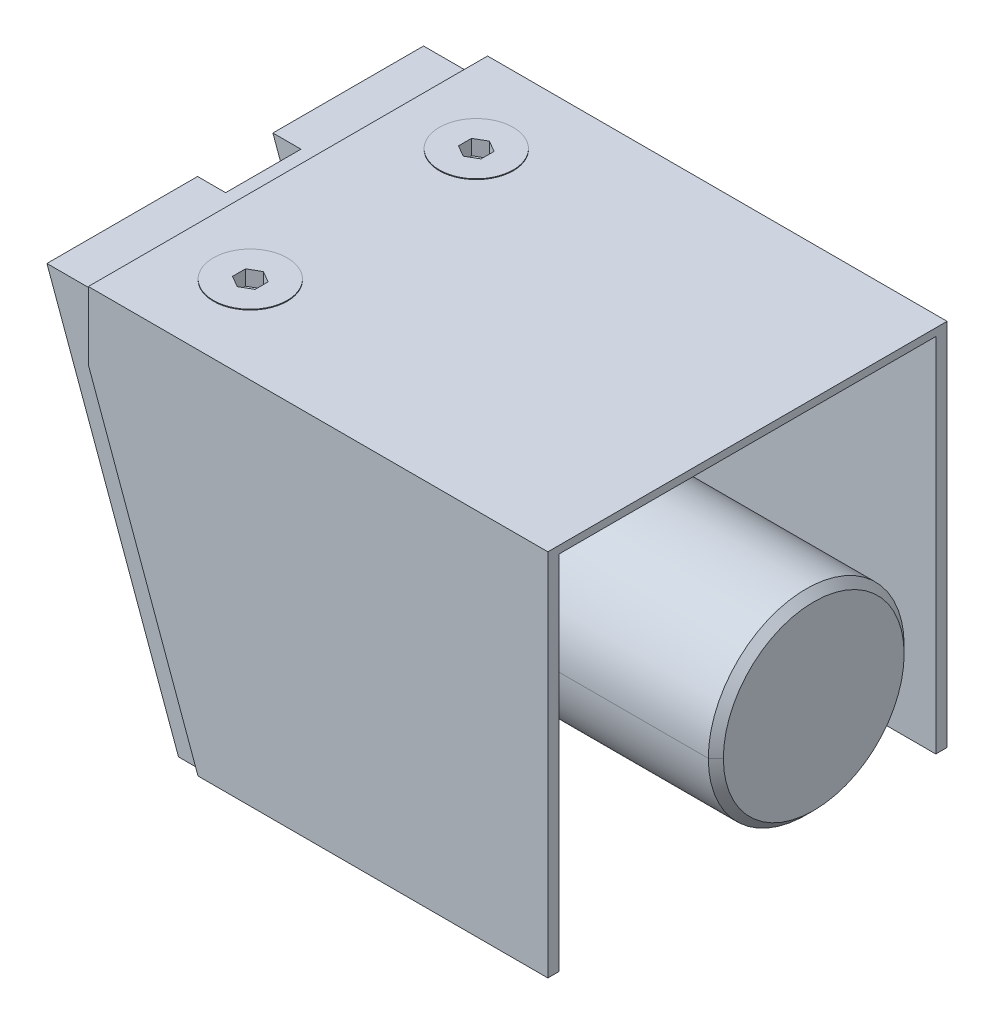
ISO-10303-21;
HEADER;
FILE_DESCRIPTION(('STEP AP214'),'2;1');
FILE_NAME('part.step','',(''),(''),'','','');
FILE_SCHEMA(('AUTOMOTIVE_DESIGN { 1 0 10303 214 1 1 1 1 }'));
ENDSEC;
DATA;
#1=APPLICATION_CONTEXT('core data for automotive mechanical design processes');
#2=APPLICATION_PROTOCOL_DEFINITION('international standard','automotive_design',2000,#1);
#3=PRODUCT_CONTEXT('',#1,'mechanical');
#4=PRODUCT('Part','Part','',(#3));
#5=PRODUCT_RELATED_PRODUCT_CATEGORY('part','',(#4));
#6=PRODUCT_DEFINITION_FORMATION('','',#4);
#7=PRODUCT_DEFINITION_CONTEXT('part definition',#1,'design');
#8=PRODUCT_DEFINITION('design','',#6,#7);
#9=PRODUCT_DEFINITION_SHAPE('','',#8);
#10=(LENGTH_UNIT() NAMED_UNIT(*) SI_UNIT(.MILLI.,.METRE.));
#11=(NAMED_UNIT(*) PLANE_ANGLE_UNIT() SI_UNIT($,.RADIAN.));
#12=(NAMED_UNIT(*) SI_UNIT($,.STERADIAN.) SOLID_ANGLE_UNIT());
#13=UNCERTAINTY_MEASURE_WITH_UNIT(LENGTH_MEASURE(1.E-05),#10,'distance_accuracy_value','');
#14=(GEOMETRIC_REPRESENTATION_CONTEXT(3) GLOBAL_UNCERTAINTY_ASSIGNED_CONTEXT((#13)) GLOBAL_UNIT_ASSIGNED_CONTEXT((#10,
#11,#12)) REPRESENTATION_CONTEXT('',''));
#15=CARTESIAN_POINT('',(0.,0.,0.));
#16=DIRECTION('',(0.,0.,1.));
#17=DIRECTION('',(1.,0.,0.));
#18=AXIS2_PLACEMENT_3D('',#15,#16,#17);
#19=CARTESIAN_POINT('',(-59.8,39.7,15.));
#20=DIRECTION('',(0.,1.,0.));
#21=DIRECTION('',(-1.,0.,0.));
#22=AXIS2_PLACEMENT_3D('',#19,#20,#21);
#23=CYLINDRICAL_SURFACE('',#22,4.9);
#24=CARTESIAN_POINT('',(-59.8,49.6,15.));
#25=DIRECTION('',(0.,1.,0.));
#26=DIRECTION('',(0.,0.,1.));
#27=AXIS2_PLACEMENT_3D('',#24,#25,#26);
#28=CIRCLE('',#27,4.9);
#29=CARTESIAN_POINT('',(-59.8,49.6,19.9));
#30=VERTEX_POINT('',#29);
#31=CARTESIAN_POINT('',(-59.8,49.6,10.1));
#32=VERTEX_POINT('',#31);
#33=EDGE_CURVE('E10',#30,#32,#28,.T.);
#34=ORIENTED_EDGE('',*,*,#33,.T.);
#35=DIRECTION('',(0.,1.,0.));
#36=VECTOR('',#35,1.);
#37=CARTESIAN_POINT('',(-59.8,49.6,10.1));
#38=LINE('',#37,#36);
#39=CARTESIAN_POINT('',(-59.8,49.7,10.1));
#40=VERTEX_POINT('',#39);
#41=EDGE_CURVE('E23',#32,#40,#38,.T.);
#42=ORIENTED_EDGE('',*,*,#41,.T.);
#43=CARTESIAN_POINT('',(-59.8,49.7,15.));
#44=DIRECTION('',(0.,-1.,0.));
#45=DIRECTION('',(0.,0.,-1.));
#46=AXIS2_PLACEMENT_3D('',#43,#44,#45);
#47=CIRCLE('',#46,4.9);
#48=CARTESIAN_POINT('',(-59.8,49.7,19.9));
#49=VERTEX_POINT('',#48);
#50=EDGE_CURVE('E1406',#40,#49,#47,.T.);
#51=ORIENTED_EDGE('',*,*,#50,.T.);
#52=DIRECTION('',(0.,1.,0.));
#53=VECTOR('',#52,1.);
#54=CARTESIAN_POINT('',(-59.8,49.6,19.9));
#55=LINE('',#54,#53);
#56=EDGE_CURVE('E1401',#30,#49,#55,.T.);
#57=ORIENTED_EDGE('',*,*,#56,.F.);
#58=EDGE_LOOP('',(#34,#42,#51,#57));
#59=FACE_BOUND('',#58,.T.);
#60=ADVANCED_FACE('F15',(#59),#23,.T.);
#61=CARTESIAN_POINT('',(-59.8,39.7,15.));
#62=DIRECTION('',(0.,1.,0.));
#63=DIRECTION('',(1.,0.,0.));
#64=AXIS2_PLACEMENT_3D('',#61,#62,#63);
#65=CYLINDRICAL_SURFACE('',#64,4.9);
#66=CARTESIAN_POINT('',(-59.8,49.7,15.));
#67=DIRECTION('',(0.,-1.,0.));
#68=DIRECTION('',(0.,0.,-1.));
#69=AXIS2_PLACEMENT_3D('',#66,#67,#68);
#70=CIRCLE('',#69,4.9);
#71=EDGE_CURVE('E1397',#49,#40,#70,.T.);
#72=ORIENTED_EDGE('',*,*,#71,.T.);
#73=ORIENTED_EDGE('',*,*,#41,.F.);
#74=CARTESIAN_POINT('',(-59.8,49.6,15.));
#75=DIRECTION('',(0.,1.,0.));
#76=DIRECTION('',(0.,0.,1.));
#77=AXIS2_PLACEMENT_3D('',#74,#75,#76);
#78=CIRCLE('',#77,4.9);
#79=EDGE_CURVE('E1392',#32,#30,#78,.T.);
#80=ORIENTED_EDGE('',*,*,#79,.T.);
#81=ORIENTED_EDGE('',*,*,#56,.T.);
#82=EDGE_LOOP('',(#72,#73,#80,#81));
#83=FACE_BOUND('',#82,.T.);
#84=ADVANCED_FACE('F1418',(#83),#65,.T.);
#85=CARTESIAN_POINT('',(0.,49.6,0.));
#86=DIRECTION('',(0.,1.,0.));
#87=DIRECTION('',(0.,0.,1.));
#88=AXIS2_PLACEMENT_3D('',#85,#86,#87);
#89=PLANE('',#88);
#90=ORIENTED_EDGE('',*,*,#33,.F.);
#91=ORIENTED_EDGE('',*,*,#79,.F.);
#92=EDGE_LOOP('',(#90,#91));
#93=FACE_BOUND('',#92,.T.);
#94=CARTESIAN_POINT('',(-59.8,49.6,-15.));
#95=DIRECTION('',(0.,1.,0.));
#96=DIRECTION('',(0.,0.,1.));
#97=AXIS2_PLACEMENT_3D('',#94,#95,#96);
#98=CIRCLE('',#97,4.9);
#99=CARTESIAN_POINT('',(-59.8,49.6,-10.1));
#100=VERTEX_POINT('',#99);
#101=CARTESIAN_POINT('',(-59.8,49.6,-19.9));
#102=VERTEX_POINT('',#101);
#103=EDGE_CURVE('E1387',#100,#102,#98,.T.);
#104=ORIENTED_EDGE('',*,*,#103,.F.);
#105=CARTESIAN_POINT('',(-59.8,49.6,-15.));
#106=DIRECTION('',(0.,1.,0.));
#107=DIRECTION('',(0.,0.,1.));
#108=AXIS2_PLACEMENT_3D('',#105,#106,#107);
#109=CIRCLE('',#108,4.9);
#110=EDGE_CURVE('E1382',#102,#100,#109,.T.);
#111=ORIENTED_EDGE('',*,*,#110,.F.);
#112=EDGE_LOOP('',(#104,#111));
#113=FACE_BOUND('',#112,.T.);
#114=DIRECTION('',(-1.,0.,0.));
#115=VECTOR('',#114,1.);
#116=CARTESIAN_POINT('',(-8.8,49.6,-26.5));
#117=LINE('',#116,#115);
#118=CARTESIAN_POINT('',(-8.8,49.6,-26.5));
#119=VERTEX_POINT('',#118);
#120=CARTESIAN_POINT('',(-69.8,49.6,-26.5));
#121=VERTEX_POINT('',#120);
#122=EDGE_CURVE('E1378',#119,#121,#117,.T.);
#123=ORIENTED_EDGE('',*,*,#122,.T.);
#124=DIRECTION('',(0.,0.,1.));
#125=VECTOR('',#124,1.);
#126=CARTESIAN_POINT('',(-69.8,49.6,-26.5));
#127=LINE('',#126,#125);
#128=CARTESIAN_POINT('',(-69.8,49.6,26.5));
#129=VERTEX_POINT('',#128);
#130=EDGE_CURVE('E1374',#121,#129,#127,.T.);
#131=ORIENTED_EDGE('',*,*,#130,.T.);
#132=DIRECTION('',(1.,0.,0.));
#133=VECTOR('',#132,1.);
#134=CARTESIAN_POINT('',(-69.8,49.6,26.5));
#135=LINE('',#134,#133);
#136=CARTESIAN_POINT('',(-8.80000000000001,49.6,26.5));
#137=VERTEX_POINT('',#136);
#138=EDGE_CURVE('E1370',#129,#137,#135,.T.);
#139=ORIENTED_EDGE('',*,*,#138,.T.);
#140=DIRECTION('',(0.,0.,-1.));
#141=VECTOR('',#140,1.);
#142=CARTESIAN_POINT('',(-8.8,49.6,26.5));
#143=LINE('',#142,#141);
#144=EDGE_CURVE('E1366',#137,#119,#143,.T.);
#145=ORIENTED_EDGE('',*,*,#144,.T.);
#146=EDGE_LOOP('',(#123,#131,#139,#145));
#147=FACE_BOUND('',#146,.T.);
#148=ADVANCED_FACE('F1472',(#93,#113,#147),#89,.T.);
#149=CARTESIAN_POINT('',(-8.8,0.6,26.5));
#150=DIRECTION('',(-1.,0.,0.));
#151=DIRECTION('',(0.,0.,1.));
#152=AXIS2_PLACEMENT_3D('',#149,#150,#151);
#153=PLANE('',#152);
#154=DIRECTION('',(0.,1.,0.));
#155=VECTOR('',#154,1.);
#156=CARTESIAN_POINT('',(-8.8,0.6,25.));
#157=LINE('',#156,#155);
#158=CARTESIAN_POINT('',(-8.8,0.6,25.));
#159=VERTEX_POINT('',#158);
#160=CARTESIAN_POINT('',(-8.8,48.6,25.));
#161=VERTEX_POINT('',#160);
#162=EDGE_CURVE('E1362',#159,#161,#157,.T.);
#163=ORIENTED_EDGE('',*,*,#162,.T.);
#164=DIRECTION('',(0.,0.,-1.));
#165=VECTOR('',#164,1.);
#166=CARTESIAN_POINT('',(-8.8,48.6,26.5));
#167=LINE('',#166,#165);
#168=CARTESIAN_POINT('',(-8.8,48.6,-25.));
#169=VERTEX_POINT('',#168);
#170=EDGE_CURVE('E1358',#161,#169,#167,.T.);
#171=ORIENTED_EDGE('',*,*,#170,.T.);
#172=DIRECTION('',(0.,1.,0.));
#173=VECTOR('',#172,1.);
#174=CARTESIAN_POINT('',(-8.8,0.6,-25.));
#175=LINE('',#174,#173);
#176=CARTESIAN_POINT('',(-8.8,0.6,-25.));
#177=VERTEX_POINT('',#176);
#178=EDGE_CURVE('E1353',#177,#169,#175,.T.);
#179=ORIENTED_EDGE('',*,*,#178,.F.);
#180=DIRECTION('',(0.,0.,1.));
#181=VECTOR('',#180,1.);
#182=CARTESIAN_POINT('',(-8.8,0.6,-26.5));
#183=LINE('',#182,#181);
#184=CARTESIAN_POINT('',(-8.8,0.6,-26.5));
#185=VERTEX_POINT('',#184);
#186=EDGE_CURVE('E1348',#185,#177,#183,.T.);
#187=ORIENTED_EDGE('',*,*,#186,.F.);
#188=DIRECTION('',(0.,1.,0.));
#189=VECTOR('',#188,1.);
#190=CARTESIAN_POINT('',(-8.8,0.6,-26.5));
#191=LINE('',#190,#189);
#192=EDGE_CURVE('E1343',#185,#119,#191,.T.);
#193=ORIENTED_EDGE('',*,*,#192,.T.);
#194=ORIENTED_EDGE('',*,*,#144,.F.);
#195=DIRECTION('',(0.,1.,0.));
#196=VECTOR('',#195,1.);
#197=CARTESIAN_POINT('',(-8.8,0.6,26.5));
#198=LINE('',#197,#196);
#199=CARTESIAN_POINT('',(-8.8,0.6,26.5));
#200=VERTEX_POINT('',#199);
#201=EDGE_CURVE('E1338',#200,#137,#198,.T.);
#202=ORIENTED_EDGE('',*,*,#201,.F.);
#203=DIRECTION('',(0.,0.,-1.));
#204=VECTOR('',#203,1.);
#205=CARTESIAN_POINT('',(-8.8,0.6,26.5));
#206=LINE('',#205,#204);
#207=EDGE_CURVE('E1334',#200,#159,#206,.T.);
#208=ORIENTED_EDGE('',*,*,#207,.T.);
#209=EDGE_LOOP('',(#163,#171,#179,#187,#193,#194,#202,#208));
#210=FACE_BOUND('',#209,.T.);
#211=ADVANCED_FACE('F1476',(#210),#153,.F.);
#212=CARTESIAN_POINT('',(-55.241190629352,0.6,26.5));
#213=DIRECTION('',(0.,1.,0.));
#214=DIRECTION('',(0.,0.,1.));
#215=AXIS2_PLACEMENT_3D('',#212,#213,#214);
#216=PLANE('',#215);
#217=DIRECTION('',(1.,0.,0.));
#218=VECTOR('',#217,1.);
#219=CARTESIAN_POINT('',(-55.241190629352,0.6,25.));
#220=LINE('',#219,#218);
#221=CARTESIAN_POINT('',(-55.241190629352,0.60000000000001,25.));
#222=VERTEX_POINT('',#221);
#223=CARTESIAN_POINT('',(-47.8,0.600000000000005,25.));
#224=VERTEX_POINT('',#223);
#225=EDGE_CURVE('E1330',#222,#224,#220,.T.);
#226=ORIENTED_EDGE('',*,*,#225,.T.);
#227=DIRECTION('',(1.,0.,0.));
#228=VECTOR('',#227,1.);
#229=CARTESIAN_POINT('',(-55.241190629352,0.6,25.));
#230=LINE('',#229,#228);
#231=EDGE_CURVE('E1325',#224,#159,#230,.T.);
#232=ORIENTED_EDGE('',*,*,#231,.T.);
#233=ORIENTED_EDGE('',*,*,#207,.F.);
#234=DIRECTION('',(1.,0.,0.));
#235=VECTOR('',#234,1.);
#236=CARTESIAN_POINT('',(-55.241190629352,0.6,26.5));
#237=LINE('',#236,#235);
#238=CARTESIAN_POINT('',(-55.241190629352,0.60000000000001,26.5));
#239=VERTEX_POINT('',#238);
#240=EDGE_CURVE('E1320',#239,#200,#237,.T.);
#241=ORIENTED_EDGE('',*,*,#240,.F.);
#242=DIRECTION('',(0.,0.,-1.));
#243=VECTOR('',#242,1.);
#244=CARTESIAN_POINT('',(-55.241190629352,0.60000000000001,26.5));
#245=LINE('',#244,#243);
#246=EDGE_CURVE('E1316',#239,#222,#245,.T.);
#247=ORIENTED_EDGE('',*,*,#246,.T.);
#248=EDGE_LOOP('',(#226,#232,#233,#241,#247));
#249=FACE_BOUND('',#248,.T.);
#250=ADVANCED_FACE('F1482',(#249),#216,.F.);
#251=CARTESIAN_POINT('',(-69.8,40.6,26.5));
#252=DIRECTION('',(0.939692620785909,0.342020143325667,0.));
#253=DIRECTION('',(-0.342020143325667,0.939692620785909,0.));
#254=AXIS2_PLACEMENT_3D('',#251,#252,#253);
#255=PLANE('',#254);
#256=DIRECTION('',(0.342020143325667,-0.939692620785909,0.));
#257=VECTOR('',#256,1.);
#258=CARTESIAN_POINT('',(-69.8,40.6,25.));
#259=LINE('',#258,#257);
#260=CARTESIAN_POINT('',(-69.8,40.6,25.));
#261=VERTEX_POINT('',#260);
#262=EDGE_CURVE('E1311',#261,#222,#259,.T.);
#263=ORIENTED_EDGE('',*,*,#262,.T.);
#264=ORIENTED_EDGE('',*,*,#246,.F.);
#265=DIRECTION('',(0.342020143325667,-0.939692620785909,0.));
#266=VECTOR('',#265,1.);
#267=CARTESIAN_POINT('',(-69.8,40.6,26.5));
#268=LINE('',#267,#266);
#269=CARTESIAN_POINT('',(-69.8,40.6,26.5));
#270=VERTEX_POINT('',#269);
#271=EDGE_CURVE('E1306',#270,#239,#268,.T.);
#272=ORIENTED_EDGE('',*,*,#271,.F.);
#273=DIRECTION('',(0.,0.,-1.));
#274=VECTOR('',#273,1.);
#275=CARTESIAN_POINT('',(-69.8,40.6,26.5));
#276=LINE('',#275,#274);
#277=EDGE_CURVE('E1302',#270,#261,#276,.T.);
#278=ORIENTED_EDGE('',*,*,#277,.T.);
#279=EDGE_LOOP('',(#263,#264,#272,#278));
#280=FACE_BOUND('',#279,.T.);
#281=ADVANCED_FACE('F1486',(#280),#255,.F.);
#282=CARTESIAN_POINT('',(-69.8,48.6,26.5));
#283=DIRECTION('',(1.,0.,0.));
#284=DIRECTION('',(0.,0.,-1.));
#285=AXIS2_PLACEMENT_3D('',#282,#283,#284);
#286=PLANE('',#285);
#287=DIRECTION('',(0.,-1.,0.));
#288=VECTOR('',#287,1.);
#289=CARTESIAN_POINT('',(-69.8,48.6,25.));
#290=LINE('',#289,#288);
#291=CARTESIAN_POINT('',(-69.8,48.6,25.));
#292=VERTEX_POINT('',#291);
#293=CARTESIAN_POINT('',(-69.8,48.,25.));
#294=VERTEX_POINT('',#293);
#295=EDGE_CURVE('E1298',#292,#294,#290,.T.);
#296=ORIENTED_EDGE('',*,*,#295,.T.);
#297=DIRECTION('',(0.,-1.,0.));
#298=VECTOR('',#297,1.);
#299=CARTESIAN_POINT('',(-69.8,48.6,25.));
#300=LINE('',#299,#298);
#301=EDGE_CURVE('E1293',#294,#261,#300,.T.);
#302=ORIENTED_EDGE('',*,*,#301,.T.);
#303=ORIENTED_EDGE('',*,*,#277,.F.);
#304=DIRECTION('',(0.,-1.,0.));
#305=VECTOR('',#304,1.);
#306=CARTESIAN_POINT('',(-69.8,48.6,26.5));
#307=LINE('',#306,#305);
#308=EDGE_CURVE('E1288',#129,#270,#307,.T.);
#309=ORIENTED_EDGE('',*,*,#308,.F.);
#310=ORIENTED_EDGE('',*,*,#130,.F.);
#311=DIRECTION('',(0.,-1.,0.));
#312=VECTOR('',#311,1.);
#313=CARTESIAN_POINT('',(-69.8,48.6,-26.5));
#314=LINE('',#313,#312);
#315=CARTESIAN_POINT('',(-69.8,40.6,-26.5));
#316=VERTEX_POINT('',#315);
#317=EDGE_CURVE('E1284',#121,#316,#314,.T.);
#318=ORIENTED_EDGE('',*,*,#317,.T.);
#319=DIRECTION('',(0.,0.,1.));
#320=VECTOR('',#319,1.);
#321=CARTESIAN_POINT('',(-69.8,40.6,-26.5));
#322=LINE('',#321,#320);
#323=CARTESIAN_POINT('',(-69.8,40.6,-25.));
#324=VERTEX_POINT('',#323);
#325=EDGE_CURVE('E1280',#316,#324,#322,.T.);
#326=ORIENTED_EDGE('',*,*,#325,.T.);
#327=DIRECTION('',(0.,-1.,0.));
#328=VECTOR('',#327,1.);
#329=CARTESIAN_POINT('',(-69.8,48.6,-25.));
#330=LINE('',#329,#328);
#331=CARTESIAN_POINT('',(-69.8,48.,-25.));
#332=VERTEX_POINT('',#331);
#333=EDGE_CURVE('E1275',#332,#324,#330,.T.);
#334=ORIENTED_EDGE('',*,*,#333,.F.);
#335=DIRECTION('',(0.,-1.,0.));
#336=VECTOR('',#335,1.);
#337=CARTESIAN_POINT('',(-69.8,48.6,-25.));
#338=LINE('',#337,#336);
#339=CARTESIAN_POINT('',(-69.8,48.6,-25.));
#340=VERTEX_POINT('',#339);
#341=EDGE_CURVE('E1270',#340,#332,#338,.T.);
#342=ORIENTED_EDGE('',*,*,#341,.F.);
#343=DIRECTION('',(0.,0.,1.));
#344=VECTOR('',#343,1.);
#345=CARTESIAN_POINT('',(-69.8,48.6,-26.5));
#346=LINE('',#345,#344);
#347=EDGE_CURVE('E1266',#340,#292,#346,.T.);
#348=ORIENTED_EDGE('',*,*,#347,.T.);
#349=EDGE_LOOP('',(#296,#302,#303,#309,#310,#318,#326,#334,#342,#348));
#350=FACE_BOUND('',#349,.T.);
#351=ADVANCED_FACE('F1490',(#350),#286,.F.);
#352=CARTESIAN_POINT('',(0.,48.6,0.));
#353=DIRECTION('',(0.,1.,0.));
#354=DIRECTION('',(0.,0.,1.));
#355=AXIS2_PLACEMENT_3D('',#352,#353,#354);
#356=PLANE('',#355);
#357=CARTESIAN_POINT('',(-59.8,48.6,15.));
#358=DIRECTION('',(0.,1.,0.));
#359=DIRECTION('',(1.,0.,0.));
#360=AXIS2_PLACEMENT_3D('',#357,#358,#359);
#361=CIRCLE('',#360,7.5);
#362=CARTESIAN_POINT('',(-52.3,48.6,15.));
#363=VERTEX_POINT('',#362);
#364=CARTESIAN_POINT('',(-67.3,48.6,15.));
#365=VERTEX_POINT('',#364);
#366=EDGE_CURVE('E1262',#363,#365,#361,.T.);
#367=ORIENTED_EDGE('',*,*,#366,.T.);
#368=CARTESIAN_POINT('',(-59.8,48.6,15.));
#369=DIRECTION('',(0.,1.,0.));
#370=DIRECTION('',(1.,0.,0.));
#371=AXIS2_PLACEMENT_3D('',#368,#369,#370);
#372=CIRCLE('',#371,7.5);
#373=EDGE_CURVE('E1258',#365,#363,#372,.T.);
#374=ORIENTED_EDGE('',*,*,#373,.T.);
#375=EDGE_LOOP('',(#367,#374));
#376=FACE_BOUND('',#375,.T.);
#377=CARTESIAN_POINT('',(-59.8,48.6,-15.));
#378=DIRECTION('',(0.,1.,0.));
#379=DIRECTION('',(1.,0.,0.));
#380=AXIS2_PLACEMENT_3D('',#377,#378,#379);
#381=CIRCLE('',#380,7.5);
#382=CARTESIAN_POINT('',(-52.3,48.6,-15.));
#383=VERTEX_POINT('',#382);
#384=CARTESIAN_POINT('',(-67.3,48.6,-15.));
#385=VERTEX_POINT('',#384);
#386=EDGE_CURVE('E1254',#383,#385,#381,.T.);
#387=ORIENTED_EDGE('',*,*,#386,.T.);
#388=CARTESIAN_POINT('',(-59.8,48.6,-15.));
#389=DIRECTION('',(0.,1.,0.));
#390=DIRECTION('',(1.,0.,0.));
#391=AXIS2_PLACEMENT_3D('',#388,#389,#390);
#392=CIRCLE('',#391,7.5);
#393=EDGE_CURVE('E1250',#385,#383,#392,.T.);
#394=ORIENTED_EDGE('',*,*,#393,.T.);
#395=EDGE_LOOP('',(#387,#394));
#396=FACE_BOUND('',#395,.T.);
#397=ORIENTED_EDGE('',*,*,#170,.F.);
#398=DIRECTION('',(-1.,0.,0.));
#399=VECTOR('',#398,1.);
#400=CARTESIAN_POINT('',(-8.8,48.6,25.));
#401=LINE('',#400,#399);
#402=EDGE_CURVE('E1245',#161,#292,#401,.T.);
#403=ORIENTED_EDGE('',*,*,#402,.T.);
#404=ORIENTED_EDGE('',*,*,#347,.F.);
#405=DIRECTION('',(-1.,0.,0.));
#406=VECTOR('',#405,1.);
#407=CARTESIAN_POINT('',(-8.8,48.6,-25.));
#408=LINE('',#407,#406);
#409=EDGE_CURVE('E1240',#169,#340,#408,.T.);
#410=ORIENTED_EDGE('',*,*,#409,.F.);
#411=EDGE_LOOP('',(#397,#403,#404,#410));
#412=FACE_BOUND('',#411,.T.);
#413=ADVANCED_FACE('F1494',(#376,#396,#412),#356,.F.);
#414=CARTESIAN_POINT('',(0.,0.,-25.));
#415=DIRECTION('',(0.,0.,1.));
#416=DIRECTION('',(1.,0.,0.));
#417=AXIS2_PLACEMENT_3D('',#414,#415,#416);
#418=PLANE('',#417);
#419=DIRECTION('',(-1.,0.,0.));
#420=VECTOR('',#419,1.);
#421=CARTESIAN_POINT('',(-47.8,48.,-25.));
#422=LINE('',#421,#420);
#423=CARTESIAN_POINT('',(-47.8,48.,-25.));
#424=VERTEX_POINT('',#423);
#425=EDGE_CURVE('E1235',#424,#332,#422,.T.);
#426=ORIENTED_EDGE('',*,*,#425,.F.);
#427=DIRECTION('',(0.,1.,0.));
#428=VECTOR('',#427,1.);
#429=CARTESIAN_POINT('',(-47.8,0.,-25.));
#430=LINE('',#429,#428);
#431=CARTESIAN_POINT('',(-47.8,0.600000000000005,-25.));
#432=VERTEX_POINT('',#431);
#433=EDGE_CURVE('E1230',#432,#424,#430,.T.);
#434=ORIENTED_EDGE('',*,*,#433,.F.);
#435=DIRECTION('',(1.,0.,0.));
#436=VECTOR('',#435,1.);
#437=CARTESIAN_POINT('',(-55.241190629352,0.6,-25.));
#438=LINE('',#437,#436);
#439=EDGE_CURVE('E1225',#432,#177,#438,.T.);
#440=ORIENTED_EDGE('',*,*,#439,.T.);
#441=ORIENTED_EDGE('',*,*,#178,.T.);
#442=ORIENTED_EDGE('',*,*,#409,.T.);
#443=ORIENTED_EDGE('',*,*,#341,.T.);
#444=EDGE_LOOP('',(#426,#434,#440,#441,#442,#443));
#445=FACE_BOUND('',#444,.T.);
#446=ADVANCED_FACE('F1498',(#445),#418,.T.);
#447=CARTESIAN_POINT('',(-55.241190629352,0.6,-26.5));
#448=DIRECTION('',(0.,-1.,0.));
#449=DIRECTION('',(0.,0.,-1.));
#450=AXIS2_PLACEMENT_3D('',#447,#448,#449);
#451=PLANE('',#450);
#452=DIRECTION('',(1.,0.,0.));
#453=VECTOR('',#452,1.);
#454=CARTESIAN_POINT('',(-55.241190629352,0.6,-25.));
#455=LINE('',#454,#453);
#456=CARTESIAN_POINT('',(-55.241190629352,0.60000000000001,-25.));
#457=VERTEX_POINT('',#456);
#458=EDGE_CURVE('E1220',#457,#432,#455,.T.);
#459=ORIENTED_EDGE('',*,*,#458,.F.);
#460=DIRECTION('',(0.,0.,1.));
#461=VECTOR('',#460,1.);
#462=CARTESIAN_POINT('',(-55.241190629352,0.60000000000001,-26.5));
#463=LINE('',#462,#461);
#464=CARTESIAN_POINT('',(-55.241190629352,0.60000000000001,-26.5));
#465=VERTEX_POINT('',#464);
#466=EDGE_CURVE('E1215',#465,#457,#463,.T.);
#467=ORIENTED_EDGE('',*,*,#466,.F.);
#468=DIRECTION('',(1.,0.,0.));
#469=VECTOR('',#468,1.);
#470=CARTESIAN_POINT('',(-55.241190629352,0.6,-26.5));
#471=LINE('',#470,#469);
#472=EDGE_CURVE('E1210',#465,#185,#471,.T.);
#473=ORIENTED_EDGE('',*,*,#472,.T.);
#474=ORIENTED_EDGE('',*,*,#186,.T.);
#475=ORIENTED_EDGE('',*,*,#439,.F.);
#476=EDGE_LOOP('',(#459,#467,#473,#474,#475));
#477=FACE_BOUND('',#476,.T.);
#478=ADVANCED_FACE('F1502',(#477),#451,.T.);
#479=CARTESIAN_POINT('',(0.,0.,-26.5));
#480=DIRECTION('',(0.,0.,1.));
#481=DIRECTION('',(1.,0.,0.));
#482=AXIS2_PLACEMENT_3D('',#479,#480,#481);
#483=PLANE('',#482);
#484=ORIENTED_EDGE('',*,*,#317,.F.);
#485=ORIENTED_EDGE('',*,*,#122,.F.);
#486=ORIENTED_EDGE('',*,*,#192,.F.);
#487=ORIENTED_EDGE('',*,*,#472,.F.);
#488=DIRECTION('',(0.342020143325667,-0.939692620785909,0.));
#489=VECTOR('',#488,1.);
#490=CARTESIAN_POINT('',(-69.8,40.6,-26.5));
#491=LINE('',#490,#489);
#492=EDGE_CURVE('E1205',#316,#465,#491,.T.);
#493=ORIENTED_EDGE('',*,*,#492,.F.);
#494=EDGE_LOOP('',(#484,#485,#486,#487,#493));
#495=FACE_BOUND('',#494,.T.);
#496=ADVANCED_FACE('F1506',(#495),#483,.F.);
#497=CARTESIAN_POINT('',(-69.8,40.6,-26.5));
#498=DIRECTION('',(-0.939692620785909,-0.342020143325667,0.));
#499=DIRECTION('',(0.342020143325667,-0.939692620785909,0.));
#500=AXIS2_PLACEMENT_3D('',#497,#498,#499);
#501=PLANE('',#500);
#502=DIRECTION('',(0.342020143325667,-0.939692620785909,0.));
#503=VECTOR('',#502,1.);
#504=CARTESIAN_POINT('',(-69.8,40.6,-25.));
#505=LINE('',#504,#503);
#506=EDGE_CURVE('E1200',#324,#457,#505,.T.);
#507=ORIENTED_EDGE('',*,*,#506,.F.);
#508=ORIENTED_EDGE('',*,*,#325,.F.);
#509=ORIENTED_EDGE('',*,*,#492,.T.);
#510=ORIENTED_EDGE('',*,*,#466,.T.);
#511=EDGE_LOOP('',(#507,#508,#509,#510));
#512=FACE_BOUND('',#511,.T.);
#513=ADVANCED_FACE('F1509',(#512),#501,.T.);
#514=CARTESIAN_POINT('',(0.,0.,-25.));
#515=DIRECTION('',(0.,0.,-1.));
#516=DIRECTION('',(-1.,0.,0.));
#517=AXIS2_PLACEMENT_3D('',#514,#515,#516);
#518=PLANE('',#517);
#519=DIRECTION('',(-1.,0.,0.));
#520=VECTOR('',#519,1.);
#521=CARTESIAN_POINT('',(-47.8,48.,-25.));
#522=LINE('',#521,#520);
#523=CARTESIAN_POINT('',(-76.8,48.,-25.));
#524=VERTEX_POINT('',#523);
#525=EDGE_CURVE('E1195',#332,#524,#522,.T.);
#526=ORIENTED_EDGE('',*,*,#525,.F.);
#527=ORIENTED_EDGE('',*,*,#333,.T.);
#528=ORIENTED_EDGE('',*,*,#506,.T.);
#529=ORIENTED_EDGE('',*,*,#458,.T.);
#530=DIRECTION('',(0.,1.,0.));
#531=VECTOR('',#530,1.);
#532=CARTESIAN_POINT('',(-47.8,0.,-25.));
#533=LINE('',#532,#531);
#534=CARTESIAN_POINT('',(-47.8,0.,-25.));
#535=VERTEX_POINT('',#534);
#536=EDGE_CURVE('E1190',#535,#432,#533,.T.);
#537=ORIENTED_EDGE('',*,*,#536,.F.);
#538=DIRECTION('',(1.,0.,0.));
#539=VECTOR('',#538,1.);
#540=CARTESIAN_POINT('',(-59.329428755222,0.,-25.));
#541=LINE('',#540,#539);
#542=CARTESIAN_POINT('',(-59.329428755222,0.,-25.));
#543=VERTEX_POINT('',#542);
#544=EDGE_CURVE('E1185',#543,#535,#541,.T.);
#545=ORIENTED_EDGE('',*,*,#544,.F.);
#546=DIRECTION('',(0.342020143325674,-0.939692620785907,0.));
#547=VECTOR('',#546,1.);
#548=CARTESIAN_POINT('',(-76.8,48.,-25.));
#549=LINE('',#548,#547);
#550=EDGE_CURVE('E1182',#524,#543,#549,.T.);
#551=ORIENTED_EDGE('',*,*,#550,.F.);
#552=EDGE_LOOP('',(#526,#527,#528,#529,#537,#545,#551));
#553=FACE_BOUND('',#552,.T.);
#554=ADVANCED_FACE('F1168',(#553),#518,.T.);
#555=CARTESIAN_POINT('',(-76.8,48.,25.));
#556=DIRECTION('',(0.939692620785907,0.342020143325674,0.));
#557=DIRECTION('',(-0.342020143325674,0.939692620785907,0.));
#558=AXIS2_PLACEMENT_3D('',#555,#556,#557);
#559=PLANE('',#558);
#560=CARTESIAN_POINT('',(-63.3331013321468,10.9999999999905,-5.00000000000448));
#561=CARTESIAN_POINT('',(-64.5463354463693,14.3333333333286,-13.));
#562=CARTESIAN_POINT('',(-67.7007441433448,23.,-13.));
#563=(BOUNDED_CURVE() B_SPLINE_CURVE(2,(#560,#561,#562),.UNSPECIFIED.,.F.,
.F.) B_SPLINE_CURVE_WITH_KNOTS((3,3),(0.,3.),
.UNSPECIFIED.) CURVE() GEOMETRIC_REPRESENTATION_ITEM() RATIONAL_B_SPLINE_CURVE((1.,
0.832050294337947,1.)) REPRESENTATION_ITEM(''));
#564=CARTESIAN_POINT('',(-63.3331013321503,11.,-5.));
#565=VERTEX_POINT('',#564);
#566=CARTESIAN_POINT('',(-67.7007441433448,23.,-13.));
#567=VERTEX_POINT('',#566);
#568=EDGE_CURVE('E920',#565,#567,#563,.T.);
#569=ORIENTED_EDGE('',*,*,#568,.T.);
#570=CARTESIAN_POINT('',(-67.7007441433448,23.,-13.));
#571=CARTESIAN_POINT('',(-70.8551528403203,31.6666666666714,-13.));
#572=CARTESIAN_POINT('',(-72.0683869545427,35.0000000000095,-5.00000000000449));
#573=(BOUNDED_CURVE() B_SPLINE_CURVE(2,(#570,#571,#572),.UNSPECIFIED.,.F.,
.F.) B_SPLINE_CURVE_WITH_KNOTS((3,3),(0.,3.),
.UNSPECIFIED.) CURVE() GEOMETRIC_REPRESENTATION_ITEM() RATIONAL_B_SPLINE_CURVE((1.,
0.832050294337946,1.)) REPRESENTATION_ITEM(''));
#574=CARTESIAN_POINT('',(-72.0683869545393,35.,-5.));
#575=VERTEX_POINT('',#574);
#576=EDGE_CURVE('E1149',#567,#575,#573,.T.);
#577=ORIENTED_EDGE('',*,*,#576,.T.);
#578=DIRECTION('',(0.342020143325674,-0.939692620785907,0.));
#579=VECTOR('',#578,1.);
#580=CARTESIAN_POINT('',(-76.8,48.,-5.));
#581=LINE('',#580,#579);
#582=CARTESIAN_POINT('',(-76.8,48.,-5.));
#583=VERTEX_POINT('',#582);
#584=EDGE_CURVE('E1144',#583,#575,#581,.T.);
#585=ORIENTED_EDGE('',*,*,#584,.F.);
#586=DIRECTION('',(0.,0.,-1.));
#587=VECTOR('',#586,1.);
#588=CARTESIAN_POINT('',(-76.8,48.,25.));
#589=LINE('',#588,#587);
#590=EDGE_CURVE('E1139',#583,#524,#589,.T.);
#591=ORIENTED_EDGE('',*,*,#590,.T.);
#592=ORIENTED_EDGE('',*,*,#550,.T.);
#593=DIRECTION('',(0.,0.,-1.));
#594=VECTOR('',#593,1.);
#595=CARTESIAN_POINT('',(-59.329428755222,0.,25.));
#596=LINE('',#595,#594);
#597=CARTESIAN_POINT('',(-59.329428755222,0.,-5.));
#598=VERTEX_POINT('',#597);
#599=EDGE_CURVE('E1134',#598,#543,#596,.T.);
#600=ORIENTED_EDGE('',*,*,#599,.F.);
#601=DIRECTION('',(0.342020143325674,-0.939692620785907,0.));
#602=VECTOR('',#601,1.);
#603=CARTESIAN_POINT('',(-76.8,48.,-5.));
#604=LINE('',#603,#602);
#605=EDGE_CURVE('E1129',#565,#598,#604,.T.);
#606=ORIENTED_EDGE('',*,*,#605,.F.);
#607=EDGE_LOOP('',(#569,#577,#585,#591,#592,#600,#606));
#608=FACE_BOUND('',#607,.T.);
#609=ADVANCED_FACE('F1157',(#608),#559,.F.);
#610=CARTESIAN_POINT('',(0.,0.,-5.));
#611=DIRECTION('',(0.,0.,1.));
#612=DIRECTION('',(1.,0.,0.));
#613=AXIS2_PLACEMENT_3D('',#610,#611,#612);
#614=PLANE('',#613);
#615=DIRECTION('',(-0.342020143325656,0.939692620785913,0.));
#616=VECTOR('',#615,1.);
#617=CARTESIAN_POINT('',(-55.604806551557,0.,-5.));
#618=LINE('',#617,#616);
#619=CARTESIAN_POINT('',(-55.604806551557,0.,-5.));
#620=VERTEX_POINT('',#619);
#621=CARTESIAN_POINT('',(-59.6084791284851,11.,-5.));
#622=VERTEX_POINT('',#621);
#623=EDGE_CURVE('E1125',#620,#622,#618,.T.);
#624=ORIENTED_EDGE('',*,*,#623,.T.);
#625=DIRECTION('',(1.,0.,0.));
#626=VECTOR('',#625,1.);
#627=CARTESIAN_POINT('',(-50.8,11.,-5.));
#628=LINE('',#627,#626);
#629=EDGE_CURVE('E1121',#565,#622,#628,.T.);
#630=ORIENTED_EDGE('',*,*,#629,.F.);
#631=ORIENTED_EDGE('',*,*,#605,.T.);
#632=DIRECTION('',(1.,0.,0.));
#633=VECTOR('',#632,1.);
#634=CARTESIAN_POINT('',(-59.329428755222,0.,-5.));
#635=LINE('',#634,#633);
#636=EDGE_CURVE('E1117',#598,#620,#635,.T.);
#637=ORIENTED_EDGE('',*,*,#636,.T.);
#638=EDGE_LOOP('',(#624,#630,#631,#637));
#639=FACE_BOUND('',#638,.T.);
#640=ADVANCED_FACE('F1167',(#639),#614,.T.);
#641=CARTESIAN_POINT('',(-59.329428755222,0.,25.));
#642=DIRECTION('',(0.,1.,0.));
#643=DIRECTION('',(0.,0.,1.));
#644=AXIS2_PLACEMENT_3D('',#641,#642,#643);
#645=PLANE('',#644);
#646=DIRECTION('',(0.,0.,-1.));
#647=VECTOR('',#646,1.);
#648=CARTESIAN_POINT('',(-59.329428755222,0.,25.));
#649=LINE('',#648,#647);
#650=CARTESIAN_POINT('',(-59.329428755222,0.,25.));
#651=VERTEX_POINT('',#650);
#652=CARTESIAN_POINT('',(-59.329428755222,0.,5.));
#653=VERTEX_POINT('',#652);
#654=EDGE_CURVE('E1113',#651,#653,#649,.T.);
#655=ORIENTED_EDGE('',*,*,#654,.T.);
#656=DIRECTION('',(1.,0.,0.));
#657=VECTOR('',#656,1.);
#658=CARTESIAN_POINT('',(-59.329428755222,0.,5.));
#659=LINE('',#658,#657);
#660=CARTESIAN_POINT('',(-55.604806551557,0.,5.));
#661=VERTEX_POINT('',#660);
#662=EDGE_CURVE('E1109',#653,#661,#659,.T.);
#663=ORIENTED_EDGE('',*,*,#662,.T.);
#664=DIRECTION('',(0.,0.,-1.));
#665=VECTOR('',#664,1.);
#666=CARTESIAN_POINT('',(-55.604806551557,0.,5.));
#667=LINE('',#666,#665);
#668=EDGE_CURVE('E1104',#661,#620,#667,.T.);
#669=ORIENTED_EDGE('',*,*,#668,.T.);
#670=ORIENTED_EDGE('',*,*,#636,.F.);
#671=ORIENTED_EDGE('',*,*,#599,.T.);
#672=ORIENTED_EDGE('',*,*,#544,.T.);
#673=DIRECTION('',(0.,0.,-1.));
#674=VECTOR('',#673,1.);
#675=CARTESIAN_POINT('',(-47.8,0.,25.));
#676=LINE('',#675,#674);
#677=CARTESIAN_POINT('',(-47.8,0.,25.));
#678=VERTEX_POINT('',#677);
#679=EDGE_CURVE('E1099',#678,#535,#676,.T.);
#680=ORIENTED_EDGE('',*,*,#679,.F.);
#681=DIRECTION('',(1.,0.,0.));
#682=VECTOR('',#681,1.);
#683=CARTESIAN_POINT('',(-59.329428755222,0.,25.));
#684=LINE('',#683,#682);
#685=EDGE_CURVE('E1094',#651,#678,#684,.T.);
#686=ORIENTED_EDGE('',*,*,#685,.F.);
#687=EDGE_LOOP('',(#655,#663,#669,#670,#671,#672,#680,#686));
#688=FACE_BOUND('',#687,.T.);
#689=ADVANCED_FACE('F1596',(#688),#645,.F.);
#690=CARTESIAN_POINT('',(0.,0.,25.));
#691=DIRECTION('',(0.,0.,-1.));
#692=DIRECTION('',(-1.,0.,0.));
#693=AXIS2_PLACEMENT_3D('',#690,#691,#692);
#694=PLANE('',#693);
#695=ORIENTED_EDGE('',*,*,#225,.F.);
#696=ORIENTED_EDGE('',*,*,#262,.F.);
#697=ORIENTED_EDGE('',*,*,#301,.F.);
#698=DIRECTION('',(-1.,0.,0.));
#699=VECTOR('',#698,1.);
#700=CARTESIAN_POINT('',(-47.8,48.,25.));
#701=LINE('',#700,#699);
#702=CARTESIAN_POINT('',(-76.8,48.,25.));
#703=VERTEX_POINT('',#702);
#704=EDGE_CURVE('E1090',#294,#703,#701,.T.);
#705=ORIENTED_EDGE('',*,*,#704,.T.);
#706=DIRECTION('',(0.342020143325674,-0.939692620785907,0.));
#707=VECTOR('',#706,1.);
#708=CARTESIAN_POINT('',(-76.8,48.,25.));
#709=LINE('',#708,#707);
#710=EDGE_CURVE('E1085',#703,#651,#709,.T.);
#711=ORIENTED_EDGE('',*,*,#710,.T.);
#712=ORIENTED_EDGE('',*,*,#685,.T.);
#713=DIRECTION('',(0.,1.,0.));
#714=VECTOR('',#713,1.);
#715=CARTESIAN_POINT('',(-47.8,0.,25.));
#716=LINE('',#715,#714);
#717=EDGE_CURVE('E1080',#678,#224,#716,.T.);
#718=ORIENTED_EDGE('',*,*,#717,.T.);
#719=EDGE_LOOP('',(#695,#696,#697,#705,#711,#712,#718));
#720=FACE_BOUND('',#719,.T.);
#721=ADVANCED_FACE('F1532',(#720),#694,.F.);
#722=CARTESIAN_POINT('',(-47.8,0.,25.));
#723=DIRECTION('',(-1.,0.,0.));
#724=DIRECTION('',(0.,0.,1.));
#725=AXIS2_PLACEMENT_3D('',#722,#723,#724);
#726=PLANE('',#725);
#727=CARTESIAN_POINT('',(-47.8,23.,0.));
#728=DIRECTION('',(-1.,0.,0.));
#729=DIRECTION('',(0.,0.,1.));
#730=AXIS2_PLACEMENT_3D('',#727,#728,#729);
#731=CIRCLE('',#730,13.);
#732=CARTESIAN_POINT('',(-47.8,23.,13.));
#733=VERTEX_POINT('',#732);
#734=CARTESIAN_POINT('',(-47.8,23.,-13.));
#735=VERTEX_POINT('',#734);
#736=EDGE_CURVE('E1076',#733,#735,#731,.T.);
#737=ORIENTED_EDGE('',*,*,#736,.T.);
#738=CARTESIAN_POINT('',(-47.8,23.,0.));
#739=DIRECTION('',(-1.,0.,0.));
#740=DIRECTION('',(0.,0.,1.));
#741=AXIS2_PLACEMENT_3D('',#738,#739,#740);
#742=CIRCLE('',#741,13.);
#743=EDGE_CURVE('E1072',#735,#733,#742,.T.);
#744=ORIENTED_EDGE('',*,*,#743,.T.);
#745=EDGE_LOOP('',(#737,#744));
#746=FACE_BOUND('',#745,.T.);
#747=ORIENTED_EDGE('',*,*,#536,.T.);
#748=ORIENTED_EDGE('',*,*,#433,.T.);
#749=DIRECTION('',(0.,0.,-1.));
#750=VECTOR('',#749,1.);
#751=CARTESIAN_POINT('',(-47.8,48.,25.));
#752=LINE('',#751,#750);
#753=CARTESIAN_POINT('',(-47.8,48.,25.));
#754=VERTEX_POINT('',#753);
#755=EDGE_CURVE('E1067',#754,#424,#752,.T.);
#756=ORIENTED_EDGE('',*,*,#755,.F.);
#757=DIRECTION('',(0.,1.,0.));
#758=VECTOR('',#757,1.);
#759=CARTESIAN_POINT('',(-47.8,0.,25.));
#760=LINE('',#759,#758);
#761=EDGE_CURVE('E1062',#224,#754,#760,.T.);
#762=ORIENTED_EDGE('',*,*,#761,.F.);
#763=ORIENTED_EDGE('',*,*,#717,.F.);
#764=ORIENTED_EDGE('',*,*,#679,.T.);
#765=EDGE_LOOP('',(#747,#748,#756,#762,#763,#764));
#766=FACE_BOUND('',#765,.T.);
#767=ADVANCED_FACE('F1548',(#746,#766),#726,.F.);
#768=CARTESIAN_POINT('',(0.,0.,25.));
#769=DIRECTION('',(0.,0.,1.));
#770=DIRECTION('',(1.,0.,0.));
#771=AXIS2_PLACEMENT_3D('',#768,#769,#770);
#772=PLANE('',#771);
#773=ORIENTED_EDGE('',*,*,#761,.T.);
#774=DIRECTION('',(-1.,0.,0.));
#775=VECTOR('',#774,1.);
#776=CARTESIAN_POINT('',(-47.8,48.,25.));
#777=LINE('',#776,#775);
#778=EDGE_CURVE('E1057',#754,#294,#777,.T.);
#779=ORIENTED_EDGE('',*,*,#778,.T.);
#780=ORIENTED_EDGE('',*,*,#295,.F.);
#781=ORIENTED_EDGE('',*,*,#402,.F.);
#782=ORIENTED_EDGE('',*,*,#162,.F.);
#783=ORIENTED_EDGE('',*,*,#231,.F.);
#784=EDGE_LOOP('',(#773,#779,#780,#781,#782,#783));
#785=FACE_BOUND('',#784,.T.);
#786=ADVANCED_FACE('F1536',(#785),#772,.F.);
#787=CARTESIAN_POINT('',(-47.8,48.,25.));
#788=DIRECTION('',(0.,-1.,0.));
#789=DIRECTION('',(0.,0.,-1.));
#790=AXIS2_PLACEMENT_3D('',#787,#788,#789);
#791=PLANE('',#790);
#792=CARTESIAN_POINT('',(-59.8,48.,15.));
#793=DIRECTION('',(0.,1.,0.));
#794=DIRECTION('',(1.,0.,0.));
#795=AXIS2_PLACEMENT_3D('',#792,#793,#794);
#796=CIRCLE('',#795,7.5);
#797=CARTESIAN_POINT('',(-52.3,48.,15.));
#798=VERTEX_POINT('',#797);
#799=CARTESIAN_POINT('',(-67.3,48.,15.));
#800=VERTEX_POINT('',#799);
#801=EDGE_CURVE('E1052',#798,#800,#796,.T.);
#802=ORIENTED_EDGE('',*,*,#801,.F.);
#803=CARTESIAN_POINT('',(-59.8,48.,15.));
#804=DIRECTION('',(0.,1.,0.));
#805=DIRECTION('',(1.,0.,0.));
#806=AXIS2_PLACEMENT_3D('',#803,#804,#805);
#807=CIRCLE('',#806,7.5);
#808=EDGE_CURVE('E1047',#800,#798,#807,.T.);
#809=ORIENTED_EDGE('',*,*,#808,.F.);
#810=EDGE_LOOP('',(#802,#809));
#811=FACE_BOUND('',#810,.T.);
#812=CARTESIAN_POINT('',(-59.8,48.,-15.));
#813=DIRECTION('',(0.,1.,0.));
#814=DIRECTION('',(1.,0.,0.));
#815=AXIS2_PLACEMENT_3D('',#812,#813,#814);
#816=CIRCLE('',#815,7.5);
#817=CARTESIAN_POINT('',(-52.3,48.,-15.));
#818=VERTEX_POINT('',#817);
#819=CARTESIAN_POINT('',(-67.3,48.,-15.));
#820=VERTEX_POINT('',#819);
#821=EDGE_CURVE('E1042',#818,#820,#816,.T.);
#822=ORIENTED_EDGE('',*,*,#821,.F.);
#823=CARTESIAN_POINT('',(-59.8,48.,-15.));
#824=DIRECTION('',(0.,1.,0.));
#825=DIRECTION('',(1.,0.,0.));
#826=AXIS2_PLACEMENT_3D('',#823,#824,#825);
#827=CIRCLE('',#826,7.5);
#828=EDGE_CURVE('E1037',#820,#818,#827,.T.);
#829=ORIENTED_EDGE('',*,*,#828,.F.);
#830=EDGE_LOOP('',(#822,#829));
#831=FACE_BOUND('',#830,.T.);
#832=DIRECTION('',(0.,0.,-1.));
#833=VECTOR('',#832,1.);
#834=CARTESIAN_POINT('',(-73.075377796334,48.,5.));
#835=LINE('',#834,#833);
#836=CARTESIAN_POINT('',(-73.075377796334,48.,5.));
#837=VERTEX_POINT('',#836);
#838=CARTESIAN_POINT('',(-73.075377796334,48.,-5.));
#839=VERTEX_POINT('',#838);
#840=EDGE_CURVE('E1032',#837,#839,#835,.T.);
#841=ORIENTED_EDGE('',*,*,#840,.F.);
#842=DIRECTION('',(-1.,0.,0.));
#843=VECTOR('',#842,1.);
#844=CARTESIAN_POINT('',(-73.075377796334,48.,5.));
#845=LINE('',#844,#843);
#846=CARTESIAN_POINT('',(-76.8,48.,5.));
#847=VERTEX_POINT('',#846);
#848=EDGE_CURVE('E1028',#837,#847,#845,.T.);
#849=ORIENTED_EDGE('',*,*,#848,.T.);
#850=DIRECTION('',(0.,0.,-1.));
#851=VECTOR('',#850,1.);
#852=CARTESIAN_POINT('',(-76.8,48.,25.));
#853=LINE('',#852,#851);
#854=EDGE_CURVE('E1023',#703,#847,#853,.T.);
#855=ORIENTED_EDGE('',*,*,#854,.F.);
#856=ORIENTED_EDGE('',*,*,#704,.F.);
#857=ORIENTED_EDGE('',*,*,#778,.F.);
#858=ORIENTED_EDGE('',*,*,#755,.T.);
#859=ORIENTED_EDGE('',*,*,#425,.T.);
#860=ORIENTED_EDGE('',*,*,#525,.T.);
#861=ORIENTED_EDGE('',*,*,#590,.F.);
#862=DIRECTION('',(-1.,0.,0.));
#863=VECTOR('',#862,1.);
#864=CARTESIAN_POINT('',(-73.075377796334,48.,-5.));
#865=LINE('',#864,#863);
#866=EDGE_CURVE('E1018',#839,#583,#865,.T.);
#867=ORIENTED_EDGE('',*,*,#866,.F.);
#868=EDGE_LOOP('',(#841,#849,#855,#856,#857,#858,#859,#860,#861,#867));
#869=FACE_BOUND('',#868,.T.);
#870=ADVANCED_FACE('F1540',(#811,#831,#869),#791,.F.);
#871=CARTESIAN_POINT('',(0.,0.,-5.));
#872=DIRECTION('',(0.,0.,1.));
#873=DIRECTION('',(1.,0.,0.));
#874=AXIS2_PLACEMENT_3D('',#871,#872,#873);
#875=PLANE('',#874);
#876=ORIENTED_EDGE('',*,*,#584,.T.);
#877=DIRECTION('',(1.,0.,0.));
#878=VECTOR('',#877,1.);
#879=CARTESIAN_POINT('',(-50.8,35.,-5.));
#880=LINE('',#879,#878);
#881=CARTESIAN_POINT('',(-68.3437647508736,35.,-5.));
#882=VERTEX_POINT('',#881);
#883=EDGE_CURVE('E1014',#575,#882,#880,.T.);
#884=ORIENTED_EDGE('',*,*,#883,.T.);
#885=DIRECTION('',(-0.342020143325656,0.939692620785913,0.));
#886=VECTOR('',#885,1.);
#887=CARTESIAN_POINT('',(-55.604806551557,0.,-5.));
#888=LINE('',#887,#886);
#889=EDGE_CURVE('E1009',#882,#839,#888,.T.);
#890=ORIENTED_EDGE('',*,*,#889,.T.);
#891=ORIENTED_EDGE('',*,*,#866,.T.);
#892=EDGE_LOOP('',(#876,#884,#890,#891));
#893=FACE_BOUND('',#892,.T.);
#894=ADVANCED_FACE('F1567',(#893),#875,.T.);
#895=CARTESIAN_POINT('',(-55.604806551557,0.,5.));
#896=DIRECTION('',(-0.939692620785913,-0.342020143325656,0.));
#897=DIRECTION('',(0.342020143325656,-0.939692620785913,0.));
#898=AXIS2_PLACEMENT_3D('',#895,#896,#897);
#899=PLANE('',#898);
#900=CARTESIAN_POINT('',(-63.9761219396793,23.,0.));
#901=DIRECTION('',(-0.939692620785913,-0.342020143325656,0.));
#902=DIRECTION('',(0.342020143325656,-0.939692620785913,0.));
#903=AXIS2_PLACEMENT_3D('',#900,#901,#902);
#904=ELLIPSE('',#903,13.8343110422,13.);
#905=CARTESIAN_POINT('',(-68.3437647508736,35.,5.));
#906=VERTEX_POINT('',#905);
#907=EDGE_CURVE('E1004',#906,#882,#904,.T.);
#908=ORIENTED_EDGE('',*,*,#907,.F.);
#909=DIRECTION('',(-0.342020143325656,0.939692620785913,0.));
#910=VECTOR('',#909,1.);
#911=CARTESIAN_POINT('',(-55.604806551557,0.,5.));
#912=LINE('',#911,#910);
#913=EDGE_CURVE('E999',#906,#837,#912,.T.);
#914=ORIENTED_EDGE('',*,*,#913,.T.);
#915=ORIENTED_EDGE('',*,*,#840,.T.);
#916=ORIENTED_EDGE('',*,*,#889,.F.);
#917=EDGE_LOOP('',(#908,#914,#915,#916));
#918=FACE_BOUND('',#917,.T.);
#919=ADVANCED_FACE('F1571',(#918),#899,.T.);
#920=CARTESIAN_POINT('',(0.,0.,5.));
#921=DIRECTION('',(0.,0.,1.));
#922=DIRECTION('',(1.,0.,0.));
#923=AXIS2_PLACEMENT_3D('',#920,#921,#922);
#924=PLANE('',#923);
#925=DIRECTION('',(1.,0.,0.));
#926=VECTOR('',#925,1.);
#927=CARTESIAN_POINT('',(-50.8,35.,5.));
#928=LINE('',#927,#926);
#929=CARTESIAN_POINT('',(-72.0683869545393,35.,5.));
#930=VERTEX_POINT('',#929);
#931=EDGE_CURVE('E995',#930,#906,#928,.T.);
#932=ORIENTED_EDGE('',*,*,#931,.F.);
#933=DIRECTION('',(0.342020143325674,-0.939692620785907,0.));
#934=VECTOR('',#933,1.);
#935=CARTESIAN_POINT('',(-76.8,48.,5.));
#936=LINE('',#935,#934);
#937=EDGE_CURVE('E993',#847,#930,#936,.T.);
#938=ORIENTED_EDGE('',*,*,#937,.F.);
#939=ORIENTED_EDGE('',*,*,#848,.F.);
#940=ORIENTED_EDGE('',*,*,#913,.F.);
#941=EDGE_LOOP('',(#932,#938,#939,#940));
#942=FACE_BOUND('',#941,.T.);
#943=ADVANCED_FACE('F979',(#942),#924,.F.);
#944=CARTESIAN_POINT('',(-76.8,48.,25.));
#945=DIRECTION('',(0.939692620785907,0.342020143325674,0.));
#946=DIRECTION('',(-0.342020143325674,0.939692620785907,0.));
#947=AXIS2_PLACEMENT_3D('',#944,#945,#946);
#948=PLANE('',#947);
#949=CARTESIAN_POINT('',(-72.0683869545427,35.0000000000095,5.00000000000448));
#950=CARTESIAN_POINT('',(-70.8551528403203,31.6666666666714,13.));
#951=CARTESIAN_POINT('',(-67.7007441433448,23.,13.));
#952=(BOUNDED_CURVE() B_SPLINE_CURVE(2,(#949,#950,#951),.UNSPECIFIED.,.F.,
.F.) B_SPLINE_CURVE_WITH_KNOTS((3,3),(0.,3.),
.UNSPECIFIED.) CURVE() GEOMETRIC_REPRESENTATION_ITEM() RATIONAL_B_SPLINE_CURVE((1.,
0.832050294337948,1.)) REPRESENTATION_ITEM(''));
#953=CARTESIAN_POINT('',(-67.7007441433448,23.,13.));
#954=VERTEX_POINT('',#953);
#955=EDGE_CURVE('E901',#930,#954,#952,.T.);
#956=ORIENTED_EDGE('',*,*,#955,.T.);
#957=CARTESIAN_POINT('',(-67.7007441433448,23.,13.));
#958=CARTESIAN_POINT('',(-64.5463354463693,14.3333333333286,13.));
#959=CARTESIAN_POINT('',(-63.3331013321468,10.9999999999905,5.00000000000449));
#960=(BOUNDED_CURVE() B_SPLINE_CURVE(2,(#957,#958,#959),.UNSPECIFIED.,.F.,
.F.) B_SPLINE_CURVE_WITH_KNOTS((3,3),(0.,3.),
.UNSPECIFIED.) CURVE() GEOMETRIC_REPRESENTATION_ITEM() RATIONAL_B_SPLINE_CURVE((1.,
0.832050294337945,1.)) REPRESENTATION_ITEM(''));
#961=CARTESIAN_POINT('',(-63.3331013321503,11.,5.));
#962=VERTEX_POINT('',#961);
#963=EDGE_CURVE('E944',#954,#962,#960,.T.);
#964=ORIENTED_EDGE('',*,*,#963,.T.);
#965=DIRECTION('',(0.342020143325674,-0.939692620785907,0.));
#966=VECTOR('',#965,1.);
#967=CARTESIAN_POINT('',(-76.8,48.,5.));
#968=LINE('',#967,#966);
#969=EDGE_CURVE('E956',#962,#653,#968,.T.);
#970=ORIENTED_EDGE('',*,*,#969,.T.);
#971=ORIENTED_EDGE('',*,*,#654,.F.);
#972=ORIENTED_EDGE('',*,*,#710,.F.);
#973=ORIENTED_EDGE('',*,*,#854,.T.);
#974=ORIENTED_EDGE('',*,*,#937,.T.);
#975=EDGE_LOOP('',(#956,#964,#970,#971,#972,#973,#974));
#976=FACE_BOUND('',#975,.T.);
#977=ADVANCED_FACE('F968',(#976),#948,.F.);
#978=CARTESIAN_POINT('',(0.,0.,5.));
#979=DIRECTION('',(0.,0.,1.));
#980=DIRECTION('',(1.,0.,0.));
#981=AXIS2_PLACEMENT_3D('',#978,#979,#980);
#982=PLANE('',#981);
#983=DIRECTION('',(1.,0.,0.));
#984=VECTOR('',#983,1.);
#985=CARTESIAN_POINT('',(-50.8,11.,5.));
#986=LINE('',#985,#984);
#987=CARTESIAN_POINT('',(-59.6084791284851,11.,5.));
#988=VERTEX_POINT('',#987);
#989=EDGE_CURVE('E952',#962,#988,#986,.T.);
#990=ORIENTED_EDGE('',*,*,#989,.T.);
#991=DIRECTION('',(-0.342020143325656,0.939692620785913,0.));
#992=VECTOR('',#991,1.);
#993=CARTESIAN_POINT('',(-55.604806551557,0.,5.));
#994=LINE('',#993,#992);
#995=EDGE_CURVE('E947',#661,#988,#994,.T.);
#996=ORIENTED_EDGE('',*,*,#995,.F.);
#997=ORIENTED_EDGE('',*,*,#662,.F.);
#998=ORIENTED_EDGE('',*,*,#969,.F.);
#999=EDGE_LOOP('',(#990,#996,#997,#998));
#1000=FACE_BOUND('',#999,.T.);
#1001=ADVANCED_FACE('F978',(#1000),#982,.F.);
#1002=CARTESIAN_POINT('',(-55.604806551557,0.,5.));
#1003=DIRECTION('',(-0.939692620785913,-0.342020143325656,0.));
#1004=DIRECTION('',(0.342020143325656,-0.939692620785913,0.));
#1005=AXIS2_PLACEMENT_3D('',#1002,#1003,#1004);
#1006=PLANE('',#1005);
#1007=ORIENTED_EDGE('',*,*,#995,.T.);
#1008=CARTESIAN_POINT('',(-63.9761219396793,23.,0.));
#1009=DIRECTION('',(-0.939692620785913,-0.342020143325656,0.));
#1010=DIRECTION('',(0.342020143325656,-0.939692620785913,0.));
#1011=AXIS2_PLACEMENT_3D('',#1008,#1009,#1010);
#1012=ELLIPSE('',#1011,13.8343110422,13.);
#1013=EDGE_CURVE('E930',#622,#988,#1012,.T.);
#1014=ORIENTED_EDGE('',*,*,#1013,.F.);
#1015=ORIENTED_EDGE('',*,*,#623,.F.);
#1016=ORIENTED_EDGE('',*,*,#668,.F.);
#1017=EDGE_LOOP('',(#1007,#1014,#1015,#1016));
#1018=FACE_BOUND('',#1017,.T.);
#1019=ADVANCED_FACE('F1579',(#1018),#1006,.T.);
#1020=CARTESIAN_POINT('',(-50.8,23.,0.));
#1021=DIRECTION('',(-1.,0.,0.));
#1022=DIRECTION('',(0.,1.,0.));
#1023=AXIS2_PLACEMENT_3D('',#1020,#1021,#1022);
#1024=CYLINDRICAL_SURFACE('',#1023,13.);
#1025=ORIENTED_EDGE('',*,*,#963,.F.);
#1026=DIRECTION('',(-1.,0.,0.));
#1027=VECTOR('',#1026,1.);
#1028=CARTESIAN_POINT('',(-50.8,23.,13.));
#1029=LINE('',#1028,#1027);
#1030=CARTESIAN_POINT('',(-50.8,23.,13.));
#1031=VERTEX_POINT('',#1030);
#1032=EDGE_CURVE('E926',#1031,#954,#1029,.T.);
#1033=ORIENTED_EDGE('',*,*,#1032,.F.);
#1034=CARTESIAN_POINT('',(-50.8,23.,0.));
#1035=DIRECTION('',(1.,0.,0.));
#1036=DIRECTION('',(0.,0.,-1.));
#1037=AXIS2_PLACEMENT_3D('',#1034,#1035,#1036);
#1038=CIRCLE('',#1037,13.);
#1039=CARTESIAN_POINT('',(-50.8,23.,-13.));
#1040=VERTEX_POINT('',#1039);
#1041=EDGE_CURVE('E922',#1031,#1040,#1038,.T.);
#1042=ORIENTED_EDGE('',*,*,#1041,.T.);
#1043=DIRECTION('',(-1.,0.,0.));
#1044=VECTOR('',#1043,1.);
#1045=CARTESIAN_POINT('',(-50.8,23.,-13.));
#1046=LINE('',#1045,#1044);
#1047=EDGE_CURVE('E904',#1040,#567,#1046,.T.);
#1048=ORIENTED_EDGE('',*,*,#1047,.T.);
#1049=ORIENTED_EDGE('',*,*,#568,.F.);
#1050=ORIENTED_EDGE('',*,*,#629,.T.);
#1051=ORIENTED_EDGE('',*,*,#1013,.T.);
#1052=ORIENTED_EDGE('',*,*,#989,.F.);
#1053=EDGE_LOOP('',(#1025,#1033,#1042,#1048,#1049,#1050,#1051,#1052));
#1054=FACE_BOUND('',#1053,.T.);
#1055=ADVANCED_FACE('F883',(#1054),#1024,.F.);
#1056=CARTESIAN_POINT('',(-50.8,23.,0.));
#1057=DIRECTION('',(-1.,0.,0.));
#1058=DIRECTION('',(0.,-1.,0.));
#1059=AXIS2_PLACEMENT_3D('',#1056,#1057,#1058);
#1060=CYLINDRICAL_SURFACE('',#1059,13.);
#1061=CARTESIAN_POINT('',(-50.8,23.,0.));
#1062=DIRECTION('',(1.,0.,0.));
#1063=DIRECTION('',(0.,0.,-1.));
#1064=AXIS2_PLACEMENT_3D('',#1061,#1062,#1063);
#1065=CIRCLE('',#1064,13.);
#1066=EDGE_CURVE('E863',#1040,#1031,#1065,.T.);
#1067=ORIENTED_EDGE('',*,*,#1066,.T.);
#1068=ORIENTED_EDGE('',*,*,#1032,.T.);
#1069=ORIENTED_EDGE('',*,*,#955,.F.);
#1070=ORIENTED_EDGE('',*,*,#931,.T.);
#1071=ORIENTED_EDGE('',*,*,#907,.T.);
#1072=ORIENTED_EDGE('',*,*,#883,.F.);
#1073=ORIENTED_EDGE('',*,*,#576,.F.);
#1074=ORIENTED_EDGE('',*,*,#1047,.F.);
#1075=EDGE_LOOP('',(#1067,#1068,#1069,#1070,#1071,#1072,#1073,#1074));
#1076=FACE_BOUND('',#1075,.T.);
#1077=ADVANCED_FACE('F872',(#1076),#1060,.F.);
#1078=CARTESIAN_POINT('',(-50.8,36.,0.));
#1079=DIRECTION('',(-1.,0.,0.));
#1080=DIRECTION('',(0.,0.,1.));
#1081=AXIS2_PLACEMENT_3D('',#1078,#1079,#1080);
#1082=PLANE('',#1081);
#1083=CARTESIAN_POINT('',(-50.8,23.,0.));
#1084=DIRECTION('',(1.,0.,0.));
#1085=DIRECTION('',(0.,0.,-1.));
#1086=AXIS2_PLACEMENT_3D('',#1083,#1084,#1085);
#1087=CIRCLE('',#1086,10.);
#1088=CARTESIAN_POINT('',(-50.8,23.,-10.));
#1089=VERTEX_POINT('',#1088);
#1090=CARTESIAN_POINT('',(-50.8,23.,10.));
#1091=VERTEX_POINT('',#1090);
#1092=EDGE_CURVE('E859',#1089,#1091,#1087,.T.);
#1093=ORIENTED_EDGE('',*,*,#1092,.T.);
#1094=CARTESIAN_POINT('',(-50.8,23.,0.));
#1095=DIRECTION('',(1.,0.,0.));
#1096=DIRECTION('',(0.,0.,-1.));
#1097=AXIS2_PLACEMENT_3D('',#1094,#1095,#1096);
#1098=CIRCLE('',#1097,10.);
#1099=EDGE_CURVE('E855',#1091,#1089,#1098,.T.);
#1100=ORIENTED_EDGE('',*,*,#1099,.T.);
#1101=EDGE_LOOP('',(#1093,#1100));
#1102=FACE_BOUND('',#1101,.T.);
#1103=ORIENTED_EDGE('',*,*,#1066,.F.);
#1104=ORIENTED_EDGE('',*,*,#1041,.F.);
#1105=EDGE_LOOP('',(#1103,#1104));
#1106=FACE_BOUND('',#1105,.T.);
#1107=ADVANCED_FACE('F882',(#1102,#1106),#1082,.T.);
#1108=CARTESIAN_POINT('',(-50.8,23.,0.));
#1109=DIRECTION('',(-1.,0.,0.));
#1110=DIRECTION('',(0.,1.,0.));
#1111=AXIS2_PLACEMENT_3D('',#1108,#1109,#1110);
#1112=CYLINDRICAL_SURFACE('',#1111,10.);
#1113=CARTESIAN_POINT('',(-75.8,23.,0.));
#1114=DIRECTION('',(1.,0.,0.));
#1115=DIRECTION('',(0.,0.,-1.));
#1116=AXIS2_PLACEMENT_3D('',#1113,#1114,#1115);
#1117=CIRCLE('',#1116,10.);
#1118=CARTESIAN_POINT('',(-75.8,23.,10.));
#1119=VERTEX_POINT('',#1118);
#1120=CARTESIAN_POINT('',(-75.8,23.,-10.));
#1121=VERTEX_POINT('',#1120);
#1122=EDGE_CURVE('E851',#1119,#1121,#1117,.T.);
#1123=ORIENTED_EDGE('',*,*,#1122,.T.);
#1124=DIRECTION('',(-1.,0.,0.));
#1125=VECTOR('',#1124,1.);
#1126=CARTESIAN_POINT('',(-50.8,23.,-10.));
#1127=LINE('',#1126,#1125);
#1128=EDGE_CURVE('E846',#1089,#1121,#1127,.T.);
#1129=ORIENTED_EDGE('',*,*,#1128,.F.);
#1130=ORIENTED_EDGE('',*,*,#1099,.F.);
#1131=DIRECTION('',(-1.,0.,0.));
#1132=VECTOR('',#1131,1.);
#1133=CARTESIAN_POINT('',(-50.8,23.,10.));
#1134=LINE('',#1133,#1132);
#1135=EDGE_CURVE('E842',#1091,#1119,#1134,.T.);
#1136=ORIENTED_EDGE('',*,*,#1135,.T.);
#1137=EDGE_LOOP('',(#1123,#1129,#1130,#1136));
#1138=FACE_BOUND('',#1137,.T.);
#1139=ADVANCED_FACE('F1657',(#1138),#1112,.T.);
#1140=CARTESIAN_POINT('',(-50.8,23.,0.));
#1141=DIRECTION('',(-1.,0.,0.));
#1142=DIRECTION('',(0.,-1.,0.));
#1143=AXIS2_PLACEMENT_3D('',#1140,#1141,#1142);
#1144=CYLINDRICAL_SURFACE('',#1143,10.);
#1145=ORIENTED_EDGE('',*,*,#1092,.F.);
#1146=ORIENTED_EDGE('',*,*,#1128,.T.);
#1147=CARTESIAN_POINT('',(-75.8,23.,0.));
#1148=DIRECTION('',(1.,0.,0.));
#1149=DIRECTION('',(0.,0.,-1.));
#1150=AXIS2_PLACEMENT_3D('',#1147,#1148,#1149);
#1151=CIRCLE('',#1150,10.);
#1152=EDGE_CURVE('E837',#1121,#1119,#1151,.T.);
#1153=ORIENTED_EDGE('',*,*,#1152,.T.);
#1154=ORIENTED_EDGE('',*,*,#1135,.F.);
#1155=EDGE_LOOP('',(#1145,#1146,#1153,#1154));
#1156=FACE_BOUND('',#1155,.T.);
#1157=ADVANCED_FACE('F1666',(#1156),#1144,.T.);
#1158=CARTESIAN_POINT('',(-75.8,23.,0.));
#1159=DIRECTION('',(1.,0.,0.));
#1160=DIRECTION('',(0.,0.,-1.));
#1161=AXIS2_PLACEMENT_3D('',#1158,#1159,#1160);
#1162=PLANE('',#1161);
#1163=ORIENTED_EDGE('',*,*,#1152,.F.);
#1164=ORIENTED_EDGE('',*,*,#1122,.F.);
#1165=EDGE_LOOP('',(#1163,#1164));
#1166=FACE_BOUND('',#1165,.T.);
#1167=CARTESIAN_POINT('',(-75.8,23.,0.));
#1168=DIRECTION('',(1.,0.,0.));
#1169=DIRECTION('',(0.,0.,-1.));
#1170=AXIS2_PLACEMENT_3D('',#1167,#1168,#1169);
#1171=CIRCLE('',#1170,3.);
#1172=CARTESIAN_POINT('',(-75.8,23.,-3.));
#1173=VERTEX_POINT('',#1172);
#1174=CARTESIAN_POINT('',(-75.8,23.,3.));
#1175=VERTEX_POINT('',#1174);
#1176=EDGE_CURVE('E833',#1173,#1175,#1171,.T.);
#1177=ORIENTED_EDGE('',*,*,#1176,.T.);
#1178=CARTESIAN_POINT('',(-75.8,23.,0.));
#1179=DIRECTION('',(1.,0.,0.));
#1180=DIRECTION('',(0.,0.,-1.));
#1181=AXIS2_PLACEMENT_3D('',#1178,#1179,#1180);
#1182=CIRCLE('',#1181,3.);
#1183=EDGE_CURVE('E829',#1175,#1173,#1182,.T.);
#1184=ORIENTED_EDGE('',*,*,#1183,.T.);
#1185=EDGE_LOOP('',(#1177,#1184));
#1186=FACE_BOUND('',#1185,.T.);
#1187=ADVANCED_FACE('F1675',(#1166,#1186),#1162,.F.);
#1188=CARTESIAN_POINT('',(-71.,23.,0.));
#1189=DIRECTION('',(-1.,0.,0.));
#1190=DIRECTION('',(0.,1.,0.));
#1191=AXIS2_PLACEMENT_3D('',#1188,#1189,#1190);
#1192=CYLINDRICAL_SURFACE('',#1191,3.);
#1193=CARTESIAN_POINT('',(-81.,23.,0.));
#1194=DIRECTION('',(1.,0.,0.));
#1195=DIRECTION('',(0.,0.,-1.));
#1196=AXIS2_PLACEMENT_3D('',#1193,#1194,#1195);
#1197=CIRCLE('',#1196,3.);
#1198=CARTESIAN_POINT('',(-81.,23.,3.));
#1199=VERTEX_POINT('',#1198);
#1200=CARTESIAN_POINT('',(-81.,23.,-3.));
#1201=VERTEX_POINT('',#1200);
#1202=EDGE_CURVE('E825',#1199,#1201,#1197,.T.);
#1203=ORIENTED_EDGE('',*,*,#1202,.T.);
#1204=DIRECTION('',(-1.,0.,0.));
#1205=VECTOR('',#1204,1.);
#1206=CARTESIAN_POINT('',(-75.8,23.,-3.));
#1207=LINE('',#1206,#1205);
#1208=EDGE_CURVE('E820',#1173,#1201,#1207,.T.);
#1209=ORIENTED_EDGE('',*,*,#1208,.F.);
#1210=ORIENTED_EDGE('',*,*,#1183,.F.);
#1211=DIRECTION('',(-1.,0.,0.));
#1212=VECTOR('',#1211,1.);
#1213=CARTESIAN_POINT('',(-75.8,23.,3.));
#1214=LINE('',#1213,#1212);
#1215=EDGE_CURVE('E816',#1175,#1199,#1214,.T.);
#1216=ORIENTED_EDGE('',*,*,#1215,.T.);
#1217=EDGE_LOOP('',(#1203,#1209,#1210,#1216));
#1218=FACE_BOUND('',#1217,.T.);
#1219=ADVANCED_FACE('F1685',(#1218),#1192,.T.);
#1220=CARTESIAN_POINT('',(-71.,23.,0.));
#1221=DIRECTION('',(-1.,0.,0.));
#1222=DIRECTION('',(0.,-1.,0.));
#1223=AXIS2_PLACEMENT_3D('',#1220,#1221,#1222);
#1224=CYLINDRICAL_SURFACE('',#1223,3.);
#1225=ORIENTED_EDGE('',*,*,#1176,.F.);
#1226=ORIENTED_EDGE('',*,*,#1208,.T.);
#1227=CARTESIAN_POINT('',(-81.,23.,0.));
#1228=DIRECTION('',(1.,0.,0.));
#1229=DIRECTION('',(0.,0.,-1.));
#1230=AXIS2_PLACEMENT_3D('',#1227,#1228,#1229);
#1231=CIRCLE('',#1230,3.);
#1232=EDGE_CURVE('E811',#1201,#1199,#1231,.T.);
#1233=ORIENTED_EDGE('',*,*,#1232,.T.);
#1234=ORIENTED_EDGE('',*,*,#1215,.F.);
#1235=EDGE_LOOP('',(#1225,#1226,#1233,#1234));
#1236=FACE_BOUND('',#1235,.T.);
#1237=ADVANCED_FACE('F1695',(#1236),#1224,.T.);
#1238=CARTESIAN_POINT('',(-81.,28.,0.));
#1239=DIRECTION('',(-1.,0.,0.));
#1240=DIRECTION('',(0.,0.,1.));
#1241=AXIS2_PLACEMENT_3D('',#1238,#1239,#1240);
#1242=PLANE('',#1241);
#1243=ORIENTED_EDGE('',*,*,#1232,.F.);
#1244=ORIENTED_EDGE('',*,*,#1202,.F.);
#1245=EDGE_LOOP('',(#1243,#1244));
#1246=FACE_BOUND('',#1245,.T.);
#1247=CARTESIAN_POINT('',(-81.,23.,0.));
#1248=DIRECTION('',(1.,0.,0.));
#1249=DIRECTION('',(0.,0.,-1.));
#1250=AXIS2_PLACEMENT_3D('',#1247,#1248,#1249);
#1251=CIRCLE('',#1250,5.);
#1252=CARTESIAN_POINT('',(-81.,23.,-5.));
#1253=VERTEX_POINT('',#1252);
#1254=CARTESIAN_POINT('',(-81.,23.,5.));
#1255=VERTEX_POINT('',#1254);
#1256=EDGE_CURVE('E807',#1253,#1255,#1251,.T.);
#1257=ORIENTED_EDGE('',*,*,#1256,.T.);
#1258=CARTESIAN_POINT('',(-81.,23.,0.));
#1259=DIRECTION('',(1.,0.,0.));
#1260=DIRECTION('',(0.,0.,-1.));
#1261=AXIS2_PLACEMENT_3D('',#1258,#1259,#1260);
#1262=CIRCLE('',#1261,5.);
#1263=EDGE_CURVE('E803',#1255,#1253,#1262,.T.);
#1264=ORIENTED_EDGE('',*,*,#1263,.T.);
#1265=EDGE_LOOP('',(#1257,#1264));
#1266=FACE_BOUND('',#1265,.T.);
#1267=ADVANCED_FACE('F1705',(#1246,#1266),#1242,.F.);
#1268=CARTESIAN_POINT('',(-71.,23.,0.));
#1269=DIRECTION('',(-1.,0.,0.));
#1270=DIRECTION('',(0.,1.,0.));
#1271=AXIS2_PLACEMENT_3D('',#1268,#1269,#1270);
#1272=CYLINDRICAL_SURFACE('',#1271,5.);
#1273=CARTESIAN_POINT('',(-84.5,23.,0.));
#1274=DIRECTION('',(1.,0.,0.));
#1275=DIRECTION('',(0.,0.,-1.));
#1276=AXIS2_PLACEMENT_3D('',#1273,#1274,#1275);
#1277=CIRCLE('',#1276,5.);
#1278=CARTESIAN_POINT('',(-84.5,23.,5.));
#1279=VERTEX_POINT('',#1278);
#1280=CARTESIAN_POINT('',(-84.5,23.,-5.));
#1281=VERTEX_POINT('',#1280);
#1282=EDGE_CURVE('E799',#1279,#1281,#1277,.T.);
#1283=ORIENTED_EDGE('',*,*,#1282,.T.);
#1284=DIRECTION('',(-1.,0.,0.));
#1285=VECTOR('',#1284,1.);
#1286=CARTESIAN_POINT('',(-81.,23.,-5.));
#1287=LINE('',#1286,#1285);
#1288=EDGE_CURVE('E794',#1253,#1281,#1287,.T.);
#1289=ORIENTED_EDGE('',*,*,#1288,.F.);
#1290=ORIENTED_EDGE('',*,*,#1263,.F.);
#1291=DIRECTION('',(-1.,0.,0.));
#1292=VECTOR('',#1291,1.);
#1293=CARTESIAN_POINT('',(-81.,23.,5.));
#1294=LINE('',#1293,#1292);
#1295=EDGE_CURVE('E790',#1255,#1279,#1294,.T.);
#1296=ORIENTED_EDGE('',*,*,#1295,.T.);
#1297=EDGE_LOOP('',(#1283,#1289,#1290,#1296));
#1298=FACE_BOUND('',#1297,.T.);
#1299=ADVANCED_FACE('F1715',(#1298),#1272,.T.);
#1300=CARTESIAN_POINT('',(-71.,23.,0.));
#1301=DIRECTION('',(-1.,0.,0.));
#1302=DIRECTION('',(0.,-1.,0.));
#1303=AXIS2_PLACEMENT_3D('',#1300,#1301,#1302);
#1304=CYLINDRICAL_SURFACE('',#1303,5.);
#1305=ORIENTED_EDGE('',*,*,#1256,.F.);
#1306=ORIENTED_EDGE('',*,*,#1288,.T.);
#1307=CARTESIAN_POINT('',(-84.5,23.,0.));
#1308=DIRECTION('',(1.,0.,0.));
#1309=DIRECTION('',(0.,0.,-1.));
#1310=AXIS2_PLACEMENT_3D('',#1307,#1308,#1309);
#1311=CIRCLE('',#1310,5.);
#1312=EDGE_CURVE('E787',#1281,#1279,#1311,.T.);
#1313=ORIENTED_EDGE('',*,*,#1312,.T.);
#1314=ORIENTED_EDGE('',*,*,#1295,.F.);
#1315=EDGE_LOOP('',(#1305,#1306,#1313,#1314));
#1316=FACE_BOUND('',#1315,.T.);
#1317=ADVANCED_FACE('F1725',(#1316),#1304,.T.);
#1318=CARTESIAN_POINT('',(-84.4999999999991,23.,0.));
#1319=DIRECTION('',(1.,0.,0.));
#1320=DIRECTION('',(0.,-1.,0.));
#1321=AXIS2_PLACEMENT_3D('',#1318,#1319,#1320);
#1322=TOROIDAL_SURFACE('',#1321,4.5,0.5);
#1323=ORIENTED_EDGE('',*,*,#1312,.F.);
#1324=CARTESIAN_POINT('',(-84.9999999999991,23.,-4.5));
#1325=CARTESIAN_POINT('',(-85.0000001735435,23.,-4.50818123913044));
#1326=CARTESIAN_POINT('',(-84.9997992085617,23.,-4.51636246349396));
#1327=CARTESIAN_POINT('',(-84.9989962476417,23.,-4.53270521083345));
#1328=CARTESIAN_POINT('',(-84.9983942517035,23.,-4.54086673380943));
#1329=CARTESIAN_POINT('',(-84.9967904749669,23.,-4.55715040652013));
#1330=CARTESIAN_POINT('',(-84.9957886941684,23.,-4.56527255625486));
#1331=CARTESIAN_POINT('',(-84.9933878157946,23.,-4.58145791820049));
#1332=CARTESIAN_POINT('',(-84.9919887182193,23.,-4.58952113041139));
#1333=CARTESIAN_POINT('',(-84.9887965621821,23.,-4.60556919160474));
#1334=CARTESIAN_POINT('',(-84.9870035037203,23.,-4.6135540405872));
#1335=CARTESIAN_POINT('',(-84.9830277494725,23.,-4.62942613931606));
#1336=CARTESIAN_POINT('',(-84.9808450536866,23.,-4.63731338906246));
#1337=CARTESIAN_POINT('',(-84.9760952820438,23.,-4.652971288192));
#1338=CARTESIAN_POINT('',(-84.9735282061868,23.,-4.66074193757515));
#1339=CARTESIAN_POINT('',(-84.9680158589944,23.,-4.67614791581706));
#1340=CARTESIAN_POINT('',(-84.9650705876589,23.,-4.68378324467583));
#1341=CARTESIAN_POINT('',(-84.9588089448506,23.,-4.69890018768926));
#1342=CARTESIAN_POINT('',(-84.9554925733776,23.,-4.70638180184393));
#1343=CARTESIAN_POINT('',(-84.948496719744,23.,-4.72117329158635));
#1344=CARTESIAN_POINT('',(-84.9448172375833,23.,-4.72848316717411));
#1345=CARTESIAN_POINT('',(-84.9371040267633,23.,-4.74291356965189));
#1346=CARTESIAN_POINT('',(-84.9330702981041,23.,-4.7500340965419));
#1347=CARTESIAN_POINT('',(-84.9246583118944,23.,-4.76406864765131));
#1348=CARTESIAN_POINT('',(-84.9202800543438,23.,-4.7709826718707));
#1349=CARTESIAN_POINT('',(-84.9111895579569,23.,-4.78458756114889));
#1350=CARTESIAN_POINT('',(-84.9064773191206,23.,-4.7912784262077));
#1351=CARTESIAN_POINT('',(-84.8967302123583,23.,-4.80442087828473));
#1352=CARTESIAN_POINT('',(-84.8916953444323,23.,-4.81087246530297));
#1353=CARTESIAN_POINT('',(-84.8813151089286,23.,-4.82352081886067));
#1354=CARTESIAN_POINT('',(-84.8759697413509,23.,-4.82971758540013));
#1355=CARTESIAN_POINT('',(-84.8649813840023,23.,-4.84184136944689));
#1356=CARTESIAN_POINT('',(-84.8593383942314,23.,-4.8477683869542));
#1357=CARTESIAN_POINT('',(-84.8477683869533,23.,-4.85933839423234));
#1358=CARTESIAN_POINT('',(-84.841841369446,23.,-4.86498138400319));
#1359=CARTESIAN_POINT('',(-84.8297175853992,23.,-4.87596974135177));
#1360=CARTESIAN_POINT('',(-84.8235208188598,23.,-4.88131510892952));
#1361=CARTESIAN_POINT('',(-84.8108724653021,23.,-4.89169534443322));
#1362=CARTESIAN_POINT('',(-84.8044208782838,23.,-4.89673021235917));
#1363=CARTESIAN_POINT('',(-84.7912784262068,23.,-4.90647731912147));
#1364=CARTESIAN_POINT('',(-84.784587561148,23.,-4.91118955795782));
#1365=CARTESIAN_POINT('',(-84.7709826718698,23.,-4.92028005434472));
#1366=CARTESIAN_POINT('',(-84.7640686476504,23.,-4.92465831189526));
#1367=CARTESIAN_POINT('',(-84.750034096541,23.,-4.93307029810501));
#1368=CARTESIAN_POINT('',(-84.742913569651,23.,-4.9371040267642));
#1369=CARTESIAN_POINT('',(-84.7284831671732,23.,-4.94481723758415));
#1370=CARTESIAN_POINT('',(-84.7211732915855,23.,-4.94849671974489));
#1371=CARTESIAN_POINT('',(-84.706381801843,23.,-4.95549257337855));
#1372=CARTESIAN_POINT('',(-84.6989001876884,23.,-4.95880894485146));
#1373=CARTESIAN_POINT('',(-84.6837832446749,23.,-4.96507058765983));
#1374=CARTESIAN_POINT('',(-84.6761479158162,23.,-4.96801585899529));
#1375=CARTESIAN_POINT('',(-84.6607419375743,23.,-4.97352820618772));
#1376=CARTESIAN_POINT('',(-84.6529712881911,23.,-4.97609528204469));
#1377=CARTESIAN_POINT('',(-84.6373133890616,23.,-4.98084505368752));
#1378=CARTESIAN_POINT('',(-84.6294261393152,23.,-4.98302774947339));
#1379=CARTESIAN_POINT('',(-84.6135540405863,23.,-4.98700350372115));
#1380=CARTESIAN_POINT('',(-84.6055691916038,23.,-4.98879656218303));
#1381=CARTESIAN_POINT('',(-84.5895211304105,23.,-4.9919887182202));
#1382=CARTESIAN_POINT('',(-84.5814579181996,23.,-4.9933878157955));
#1383=CARTESIAN_POINT('',(-84.565272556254,23.,-4.99578869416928));
#1384=CARTESIAN_POINT('',(-84.5571504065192,23.,-4.99679047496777));
#1385=CARTESIAN_POINT('',(-84.5408667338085,23.,-4.99839425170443));
#1386=CARTESIAN_POINT('',(-84.5327052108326,23.,-4.9989962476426));
#1387=CARTESIAN_POINT('',(-84.5163624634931,23.,-4.99979920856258));
#1388=CARTESIAN_POINT('',(-84.5081812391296,23.,-5.00000017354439));
#1389=CARTESIAN_POINT('',(-84.4999999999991,23.,-5.));
#1390=B_SPLINE_CURVE_WITH_KNOTS('',3,(#1324,#1325,#1326,#1327,#1328,#1329,#1330,#1331,#1332,
#1333,#1334,#1335,#1336,#1337,#1338,#1339,#1340,#1341,#1342,#1343,#1344,#1345,#1346,#1347,#1348,
#1349,#1350,#1351,#1352,#1353,#1354,#1355,#1356,#1357,#1358,#1359,#1360,#1361,#1362,#1363,#1364,
#1365,#1366,#1367,#1368,#1369,#1370,#1371,#1372,#1373,#1374,#1375,#1376,#1377,#1378,#1379,#1380,
#1381,#1382,#1383,#1384,#1385,#1386,#1387,#1388,#1389),.UNSPECIFIED.,.F.,.F.,(4,2,2,2,2,2,2,2,2,
2,2,2,2,2,2,2,2,2,2,2,2,2,2,2,2,2,2,2,2,2,2,2,4),(0.,0.0245412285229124,0.0490824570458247,
0.0736236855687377,0.0981649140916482,0.122706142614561,0.147247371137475,0.171788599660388,
0.196329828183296,0.220871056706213,0.245412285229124,0.269953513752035,0.294494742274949,
0.319035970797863,0.343577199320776,0.368118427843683,0.392659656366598,0.417200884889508,
0.441742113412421,0.466283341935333,0.490824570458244,0.515365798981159,0.53990702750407,
0.564448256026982,0.5889894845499,0.613530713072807,0.638071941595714,0.662613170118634,
0.687154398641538,0.711695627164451,0.736236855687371,0.760778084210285,0.785319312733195),.UNSPECIFIED.);
#1391=CARTESIAN_POINT('',(-85.,23.,-4.5));
#1392=VERTEX_POINT('',#1391);
#1393=EDGE_CURVE('E757',#1392,#1281,#1390,.T.);
#1394=ORIENTED_EDGE('',*,*,#1393,.F.);
#1395=CARTESIAN_POINT('',(-85.,23.,0.));
#1396=DIRECTION('',(1.,0.,0.));
#1397=DIRECTION('',(0.,0.,-1.));
#1398=AXIS2_PLACEMENT_3D('',#1395,#1396,#1397);
#1399=CIRCLE('',#1398,4.5);
#1400=CARTESIAN_POINT('',(-84.9999999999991,23.,4.5));
#1401=VERTEX_POINT('',#1400);
#1402=EDGE_CURVE('E774',#1392,#1401,#1399,.T.);
#1403=ORIENTED_EDGE('',*,*,#1402,.T.);
#1404=CARTESIAN_POINT('',(-84.9999999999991,23.,4.5));
#1405=CARTESIAN_POINT('',(-85.0000001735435,23.,4.50818123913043));
#1406=CARTESIAN_POINT('',(-84.9997992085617,23.,4.51636246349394));
#1407=CARTESIAN_POINT('',(-84.9989962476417,23.,4.53270521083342));
#1408=CARTESIAN_POINT('',(-84.9983942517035,23.,4.54086673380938));
#1409=CARTESIAN_POINT('',(-84.9967904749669,23.,4.55715040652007));
#1410=CARTESIAN_POINT('',(-84.9957886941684,23.,4.56527255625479));
#1411=CARTESIAN_POINT('',(-84.9933878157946,23.,4.5814579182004));
#1412=CARTESIAN_POINT('',(-84.9919887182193,23.,4.58952113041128));
#1413=CARTESIAN_POINT('',(-84.9887965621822,23.,4.60556919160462));
#1414=CARTESIAN_POINT('',(-84.9870035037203,23.,4.61355404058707));
#1415=CARTESIAN_POINT('',(-84.9830277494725,23.,4.62942613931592));
#1416=CARTESIAN_POINT('',(-84.9808450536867,23.,4.6373133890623));
#1417=CARTESIAN_POINT('',(-84.9760952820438,23.,4.65297128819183));
#1418=CARTESIAN_POINT('',(-84.9735282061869,23.,4.66074193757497));
#1419=CARTESIAN_POINT('',(-84.9680158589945,23.,4.67614791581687));
#1420=CARTESIAN_POINT('',(-84.965070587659,23.,4.68378324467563));
#1421=CARTESIAN_POINT('',(-84.9588089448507,23.,4.69890018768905));
#1422=CARTESIAN_POINT('',(-84.9554925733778,23.,4.70638180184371));
#1423=CARTESIAN_POINT('',(-84.9484967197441,23.,4.72117329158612));
#1424=CARTESIAN_POINT('',(-84.9448172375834,23.,4.72848316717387));
#1425=CARTESIAN_POINT('',(-84.9371040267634,23.,4.74291356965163));
#1426=CARTESIAN_POINT('',(-84.9330702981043,23.,4.75003409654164));
#1427=CARTESIAN_POINT('',(-84.9246583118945,23.,4.76406864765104));
#1428=CARTESIAN_POINT('',(-84.920280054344,23.,4.77098267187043));
#1429=CARTESIAN_POINT('',(-84.9111895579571,23.,4.78458756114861));
#1430=CARTESIAN_POINT('',(-84.9064773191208,23.,4.79127842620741));
#1431=CARTESIAN_POINT('',(-84.8967302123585,23.,4.80442087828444));
#1432=CARTESIAN_POINT('',(-84.8916953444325,23.,4.81087246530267));
#1433=CARTESIAN_POINT('',(-84.8813151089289,23.,4.82352081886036));
#1434=CARTESIAN_POINT('',(-84.8759697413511,23.,4.82971758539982));
#1435=CARTESIAN_POINT('',(-84.8649813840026,23.,4.84184136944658));
#1436=CARTESIAN_POINT('',(-84.8593383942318,23.,4.84776838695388));
#1437=CARTESIAN_POINT('',(-84.8477683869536,23.,4.85933839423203));
#1438=CARTESIAN_POINT('',(-84.8418413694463,23.,4.86498138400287));
#1439=CARTESIAN_POINT('',(-84.8297175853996,23.,4.87596974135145));
#1440=CARTESIAN_POINT('',(-84.8235208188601,23.,4.8813151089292));
#1441=CARTESIAN_POINT('',(-84.8108724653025,23.,4.8916953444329));
#1442=CARTESIAN_POINT('',(-84.8044208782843,23.,4.89673021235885));
#1443=CARTESIAN_POINT('',(-84.7912784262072,23.,4.90647731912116));
#1444=CARTESIAN_POINT('',(-84.7845875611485,23.,4.91118955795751));
#1445=CARTESIAN_POINT('',(-84.7709826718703,23.,4.92028005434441));
#1446=CARTESIAN_POINT('',(-84.7640686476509,23.,4.92465831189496));
#1447=CARTESIAN_POINT('',(-84.7500340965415,23.,4.93307029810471));
#1448=CARTESIAN_POINT('',(-84.7429135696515,23.,4.93710402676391));
#1449=CARTESIAN_POINT('',(-84.7284831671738,23.,4.94481723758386));
#1450=CARTESIAN_POINT('',(-84.721173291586,23.,4.94849671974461));
#1451=CARTESIAN_POINT('',(-84.7063818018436,23.,4.95549257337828));
#1452=CARTESIAN_POINT('',(-84.698900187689,23.,4.95880894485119));
#1453=CARTESIAN_POINT('',(-84.6837832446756,23.,4.96507058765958));
#1454=CARTESIAN_POINT('',(-84.6761479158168,23.,4.96801585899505));
#1455=CARTESIAN_POINT('',(-84.6607419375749,23.,4.97352820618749));
#1456=CARTESIAN_POINT('',(-84.6529712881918,23.,4.97609528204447));
#1457=CARTESIAN_POINT('',(-84.6373133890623,23.,4.98084505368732));
#1458=CARTESIAN_POINT('',(-84.6294261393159,23.,4.9830277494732));
#1459=CARTESIAN_POINT('',(-84.6135540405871,23.,4.98700350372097));
#1460=CARTESIAN_POINT('',(-84.6055691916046,23.,4.98879656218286));
#1461=CARTESIAN_POINT('',(-84.5895211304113,23.,4.99198871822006));
#1462=CARTESIAN_POINT('',(-84.5814579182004,23.,4.99338781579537));
#1463=CARTESIAN_POINT('',(-84.5652725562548,23.,4.99578869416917));
#1464=CARTESIAN_POINT('',(-84.5571504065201,23.,4.99679047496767));
#1465=CARTESIAN_POINT('',(-84.5408667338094,23.,4.99839425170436));
#1466=CARTESIAN_POINT('',(-84.5327052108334,23.,4.99899624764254));
#1467=CARTESIAN_POINT('',(-84.5163624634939,23.,4.99979920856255));
#1468=CARTESIAN_POINT('',(-84.5081812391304,23.,5.00000017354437));
#1469=CARTESIAN_POINT('',(-84.5,23.,5.));
#1470=B_SPLINE_CURVE_WITH_KNOTS('',3,(#1404,#1405,#1406,#1407,#1408,#1409,#1410,#1411,#1412,
#1413,#1414,#1415,#1416,#1417,#1418,#1419,#1420,#1421,#1422,#1423,#1424,#1425,#1426,#1427,#1428,
#1429,#1430,#1431,#1432,#1433,#1434,#1435,#1436,#1437,#1438,#1439,#1440,#1441,#1442,#1443,#1444,
#1445,#1446,#1447,#1448,#1449,#1450,#1451,#1452,#1453,#1454,#1455,#1456,#1457,#1458,#1459,#1460,
#1461,#1462,#1463,#1464,#1465,#1466,#1467,#1468,#1469),.UNSPECIFIED.,.F.,.F.,(4,2,2,2,2,2,2,2,2,
2,2,2,2,2,2,2,2,2,2,2,2,2,2,2,2,2,2,2,2,2,2,2,4),(0.,0.0245412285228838,0.0490824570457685,
0.073623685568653,0.098164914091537,0.122706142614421,0.147247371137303,0.17178859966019,
0.196329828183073,0.220871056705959,0.245412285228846,0.269953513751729,0.294494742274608,
0.319035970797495,0.343577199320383,0.368118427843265,0.392659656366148,0.417200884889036,
0.441742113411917,0.466283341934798,0.49082457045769,0.515365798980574,0.539907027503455,
0.564448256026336,0.588989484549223,0.613530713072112,0.638071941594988,0.662613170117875,
0.687154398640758,0.71169562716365,0.736236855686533,0.760778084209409,0.785319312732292),.UNSPECIFIED.);
#1471=EDGE_CURVE('E759',#1401,#1279,#1470,.T.);
#1472=ORIENTED_EDGE('',*,*,#1471,.T.);
#1473=EDGE_LOOP('',(#1323,#1394,#1403,#1472));
#1474=FACE_BOUND('',#1473,.T.);
#1475=ADVANCED_FACE('F739',(#1474),#1322,.T.);
#1476=CARTESIAN_POINT('',(-84.4999999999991,23.,0.));
#1477=DIRECTION('',(1.,0.,0.));
#1478=DIRECTION('',(0.,1.,0.));
#1479=AXIS2_PLACEMENT_3D('',#1476,#1477,#1478);
#1480=TOROIDAL_SURFACE('',#1479,4.5,0.5);
#1481=CARTESIAN_POINT('',(-85.,23.,0.));
#1482=DIRECTION('',(1.,0.,0.));
#1483=DIRECTION('',(0.,0.,-1.));
#1484=AXIS2_PLACEMENT_3D('',#1481,#1482,#1483);
#1485=CIRCLE('',#1484,4.5);
#1486=EDGE_CURVE('E719',#1401,#1392,#1485,.T.);
#1487=ORIENTED_EDGE('',*,*,#1486,.T.);
#1488=ORIENTED_EDGE('',*,*,#1393,.T.);
#1489=ORIENTED_EDGE('',*,*,#1282,.F.);
#1490=ORIENTED_EDGE('',*,*,#1471,.F.);
#1491=EDGE_LOOP('',(#1487,#1488,#1489,#1490));
#1492=FACE_BOUND('',#1491,.T.);
#1493=ADVANCED_FACE('F728',(#1492),#1480,.T.);
#1494=CARTESIAN_POINT('',(-85.,23.,0.));
#1495=DIRECTION('',(1.,0.,0.));
#1496=DIRECTION('',(0.,0.,-1.));
#1497=AXIS2_PLACEMENT_3D('',#1494,#1495,#1496);
#1498=PLANE('',#1497);
#1499=ORIENTED_EDGE('',*,*,#1402,.F.);
#1500=ORIENTED_EDGE('',*,*,#1486,.F.);
#1501=EDGE_LOOP('',(#1499,#1500));
#1502=FACE_BOUND('',#1501,.T.);
#1503=DIRECTION('',(0.,0.866025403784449,-0.499999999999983));
#1504=VECTOR('',#1503,1.);
#1505=CARTESIAN_POINT('',(-85.,23.,2.3094010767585));
#1506=LINE('',#1505,#1504);
#1507=CARTESIAN_POINT('',(-85.,23.,2.3094010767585));
#1508=VERTEX_POINT('',#1507);
#1509=CARTESIAN_POINT('',(-85.,25.,1.1547005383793));
#1510=VERTEX_POINT('',#1509);
#1511=EDGE_CURVE('E714',#1508,#1510,#1506,.T.);
#1512=ORIENTED_EDGE('',*,*,#1511,.F.);
#1513=DIRECTION('',(0.,0.866025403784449,0.499999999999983));
#1514=VECTOR('',#1513,1.);
#1515=CARTESIAN_POINT('',(-85.,21.,1.1547005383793));
#1516=LINE('',#1515,#1514);
#1517=CARTESIAN_POINT('',(-85.,21.,1.1547005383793));
#1518=VERTEX_POINT('',#1517);
#1519=EDGE_CURVE('E709',#1518,#1508,#1516,.T.);
#1520=ORIENTED_EDGE('',*,*,#1519,.F.);
#1521=DIRECTION('',(0.,0.,1.));
#1522=VECTOR('',#1521,1.);
#1523=CARTESIAN_POINT('',(-85.,21.,-1.1547005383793));
#1524=LINE('',#1523,#1522);
#1525=CARTESIAN_POINT('',(-85.,21.,-1.1547005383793));
#1526=VERTEX_POINT('',#1525);
#1527=EDGE_CURVE('E704',#1526,#1518,#1524,.T.);
#1528=ORIENTED_EDGE('',*,*,#1527,.F.);
#1529=DIRECTION('',(0.,-0.866025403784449,0.499999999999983));
#1530=VECTOR('',#1529,1.);
#1531=CARTESIAN_POINT('',(-85.,23.,-2.3094010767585));
#1532=LINE('',#1531,#1530);
#1533=CARTESIAN_POINT('',(-85.,23.,-2.3094010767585));
#1534=VERTEX_POINT('',#1533);
#1535=EDGE_CURVE('E699',#1534,#1526,#1532,.T.);
#1536=ORIENTED_EDGE('',*,*,#1535,.F.);
#1537=DIRECTION('',(0.,-0.866025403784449,-0.499999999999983));
#1538=VECTOR('',#1537,1.);
#1539=CARTESIAN_POINT('',(-85.,25.,-1.1547005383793));
#1540=LINE('',#1539,#1538);
#1541=CARTESIAN_POINT('',(-85.,25.,-1.1547005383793));
#1542=VERTEX_POINT('',#1541);
#1543=EDGE_CURVE('E694',#1542,#1534,#1540,.T.);
#1544=ORIENTED_EDGE('',*,*,#1543,.F.);
#1545=DIRECTION('',(0.,0.,1.));
#1546=VECTOR('',#1545,1.);
#1547=CARTESIAN_POINT('',(-85.,25.,0.));
#1548=LINE('',#1547,#1546);
#1549=EDGE_CURVE('E690',#1542,#1510,#1548,.T.);
#1550=ORIENTED_EDGE('',*,*,#1549,.T.);
#1551=EDGE_LOOP('',(#1512,#1520,#1528,#1536,#1544,#1550));
#1552=FACE_BOUND('',#1551,.T.);
#1553=ADVANCED_FACE('F738',(#1502,#1552),#1498,.F.);
#1554=CARTESIAN_POINT('',(-83.,25.,1.1547005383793));
#1555=DIRECTION('',(0.,1.,0.));
#1556=DIRECTION('',(0.,0.,1.));
#1557=AXIS2_PLACEMENT_3D('',#1554,#1555,#1556);
#1558=PLANE('',#1557);
#1559=DIRECTION('',(-1.,0.,0.));
#1560=VECTOR('',#1559,1.);
#1561=CARTESIAN_POINT('',(-83.,25.,1.1547005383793));
#1562=LINE('',#1561,#1560);
#1563=CARTESIAN_POINT('',(-83.,25.,1.1547005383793));
#1564=VERTEX_POINT('',#1563);
#1565=EDGE_CURVE('E685',#1564,#1510,#1562,.T.);
#1566=ORIENTED_EDGE('',*,*,#1565,.T.);
#1567=ORIENTED_EDGE('',*,*,#1549,.F.);
#1568=DIRECTION('',(-1.,0.,0.));
#1569=VECTOR('',#1568,1.);
#1570=CARTESIAN_POINT('',(-83.,25.,-1.1547005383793));
#1571=LINE('',#1570,#1569);
#1572=CARTESIAN_POINT('',(-83.,25.,-1.1547005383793));
#1573=VERTEX_POINT('',#1572);
#1574=EDGE_CURVE('E680',#1573,#1542,#1571,.T.);
#1575=ORIENTED_EDGE('',*,*,#1574,.F.);
#1576=DIRECTION('',(0.,0.,-1.));
#1577=VECTOR('',#1576,1.);
#1578=CARTESIAN_POINT('',(-83.,25.,1.1547005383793));
#1579=LINE('',#1578,#1577);
#1580=EDGE_CURVE('E675',#1564,#1573,#1579,.T.);
#1581=ORIENTED_EDGE('',*,*,#1580,.F.);
#1582=EDGE_LOOP('',(#1566,#1567,#1575,#1581));
#1583=FACE_BOUND('',#1582,.T.);
#1584=ADVANCED_FACE('F1756',(#1583),#1558,.F.);
#1585=CARTESIAN_POINT('',(-83.,0.,0.));
#1586=DIRECTION('',(-1.,0.,0.));
#1587=DIRECTION('',(0.,0.,1.));
#1588=AXIS2_PLACEMENT_3D('',#1585,#1586,#1587);
#1589=PLANE('',#1588);
#1590=DIRECTION('',(0.,0.,1.));
#1591=VECTOR('',#1590,1.);
#1592=CARTESIAN_POINT('',(-83.,21.,-1.1547005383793));
#1593=LINE('',#1592,#1591);
#1594=CARTESIAN_POINT('',(-83.,21.,-1.1547005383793));
#1595=VERTEX_POINT('',#1594);
#1596=CARTESIAN_POINT('',(-83.,21.,1.1547005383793));
#1597=VERTEX_POINT('',#1596);
#1598=EDGE_CURVE('E671',#1595,#1597,#1593,.T.);
#1599=ORIENTED_EDGE('',*,*,#1598,.T.);
#1600=DIRECTION('',(0.,0.866025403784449,0.499999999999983));
#1601=VECTOR('',#1600,1.);
#1602=CARTESIAN_POINT('',(-83.,21.,1.1547005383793));
#1603=LINE('',#1602,#1601);
#1604=CARTESIAN_POINT('',(-83.,23.,2.3094010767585));
#1605=VERTEX_POINT('',#1604);
#1606=EDGE_CURVE('E667',#1597,#1605,#1603,.T.);
#1607=ORIENTED_EDGE('',*,*,#1606,.T.);
#1608=DIRECTION('',(0.,0.866025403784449,-0.499999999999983));
#1609=VECTOR('',#1608,1.);
#1610=CARTESIAN_POINT('',(-83.,23.,2.3094010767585));
#1611=LINE('',#1610,#1609);
#1612=EDGE_CURVE('E662',#1605,#1564,#1611,.T.);
#1613=ORIENTED_EDGE('',*,*,#1612,.T.);
#1614=ORIENTED_EDGE('',*,*,#1580,.T.);
#1615=DIRECTION('',(0.,-0.866025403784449,-0.499999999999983));
#1616=VECTOR('',#1615,1.);
#1617=CARTESIAN_POINT('',(-83.,25.,-1.1547005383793));
#1618=LINE('',#1617,#1616);
#1619=CARTESIAN_POINT('',(-83.,23.,-2.3094010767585));
#1620=VERTEX_POINT('',#1619);
#1621=EDGE_CURVE('E658',#1573,#1620,#1618,.T.);
#1622=ORIENTED_EDGE('',*,*,#1621,.T.);
#1623=DIRECTION('',(0.,-0.866025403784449,0.499999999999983));
#1624=VECTOR('',#1623,1.);
#1625=CARTESIAN_POINT('',(-83.,23.,-2.3094010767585));
#1626=LINE('',#1625,#1624);
#1627=EDGE_CURVE('E654',#1620,#1595,#1626,.T.);
#1628=ORIENTED_EDGE('',*,*,#1627,.T.);
#1629=EDGE_LOOP('',(#1599,#1607,#1613,#1614,#1622,#1628));
#1630=FACE_BOUND('',#1629,.T.);
#1631=ADVANCED_FACE('F1765',(#1630),#1589,.T.);
#1632=CARTESIAN_POINT('',(-83.,23.,-2.3094010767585));
#1633=DIRECTION('',(0.,-0.499999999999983,-0.866025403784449));
#1634=DIRECTION('',(0.,0.866025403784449,-0.499999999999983));
#1635=AXIS2_PLACEMENT_3D('',#1632,#1633,#1634);
#1636=PLANE('',#1635);
#1637=ORIENTED_EDGE('',*,*,#1535,.T.);
#1638=DIRECTION('',(-1.,0.,0.));
#1639=VECTOR('',#1638,1.);
#1640=CARTESIAN_POINT('',(-83.,21.,-1.1547005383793));
#1641=LINE('',#1640,#1639);
#1642=EDGE_CURVE('E649',#1595,#1526,#1641,.T.);
#1643=ORIENTED_EDGE('',*,*,#1642,.F.);
#1644=ORIENTED_EDGE('',*,*,#1627,.F.);
#1645=DIRECTION('',(-1.,0.,0.));
#1646=VECTOR('',#1645,1.);
#1647=CARTESIAN_POINT('',(-83.,23.,-2.3094010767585));
#1648=LINE('',#1647,#1646);
#1649=EDGE_CURVE('E644',#1620,#1534,#1648,.T.);
#1650=ORIENTED_EDGE('',*,*,#1649,.T.);
#1651=EDGE_LOOP('',(#1637,#1643,#1644,#1650));
#1652=FACE_BOUND('',#1651,.T.);
#1653=ADVANCED_FACE('F1774',(#1652),#1636,.F.);
#1654=CARTESIAN_POINT('',(-83.,25.,-1.1547005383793));
#1655=DIRECTION('',(0.,0.499999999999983,-0.866025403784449));
#1656=DIRECTION('',(0.,0.866025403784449,0.499999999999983));
#1657=AXIS2_PLACEMENT_3D('',#1654,#1655,#1656);
#1658=PLANE('',#1657);
#1659=ORIENTED_EDGE('',*,*,#1543,.T.);
#1660=ORIENTED_EDGE('',*,*,#1649,.F.);
#1661=ORIENTED_EDGE('',*,*,#1621,.F.);
#1662=ORIENTED_EDGE('',*,*,#1574,.T.);
#1663=EDGE_LOOP('',(#1659,#1660,#1661,#1662));
#1664=FACE_BOUND('',#1663,.T.);
#1665=ADVANCED_FACE('F1784',(#1664),#1658,.F.);
#1666=CARTESIAN_POINT('',(-83.,21.,-1.1547005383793));
#1667=DIRECTION('',(0.,-1.,0.));
#1668=DIRECTION('',(0.,0.,-1.));
#1669=AXIS2_PLACEMENT_3D('',#1666,#1667,#1668);
#1670=PLANE('',#1669);
#1671=ORIENTED_EDGE('',*,*,#1527,.T.);
#1672=DIRECTION('',(-1.,0.,0.));
#1673=VECTOR('',#1672,1.);
#1674=CARTESIAN_POINT('',(-83.,21.,1.1547005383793));
#1675=LINE('',#1674,#1673);
#1676=EDGE_CURVE('E639',#1597,#1518,#1675,.T.);
#1677=ORIENTED_EDGE('',*,*,#1676,.F.);
#1678=ORIENTED_EDGE('',*,*,#1598,.F.);
#1679=ORIENTED_EDGE('',*,*,#1642,.T.);
#1680=EDGE_LOOP('',(#1671,#1677,#1678,#1679));
#1681=FACE_BOUND('',#1680,.T.);
#1682=ADVANCED_FACE('F1794',(#1681),#1670,.F.);
#1683=CARTESIAN_POINT('',(-83.,21.,1.1547005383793));
#1684=DIRECTION('',(0.,-0.499999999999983,0.866025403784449));
#1685=DIRECTION('',(0.,-0.866025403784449,-0.499999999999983));
#1686=AXIS2_PLACEMENT_3D('',#1683,#1684,#1685);
#1687=PLANE('',#1686);
#1688=ORIENTED_EDGE('',*,*,#1519,.T.);
#1689=DIRECTION('',(-1.,0.,0.));
#1690=VECTOR('',#1689,1.);
#1691=CARTESIAN_POINT('',(-83.,23.,2.3094010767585));
#1692=LINE('',#1691,#1690);
#1693=EDGE_CURVE('E634',#1605,#1508,#1692,.T.);
#1694=ORIENTED_EDGE('',*,*,#1693,.F.);
#1695=ORIENTED_EDGE('',*,*,#1606,.F.);
#1696=ORIENTED_EDGE('',*,*,#1676,.T.);
#1697=EDGE_LOOP('',(#1688,#1694,#1695,#1696));
#1698=FACE_BOUND('',#1697,.T.);
#1699=ADVANCED_FACE('F1804',(#1698),#1687,.F.);
#1700=CARTESIAN_POINT('',(-83.,23.,2.3094010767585));
#1701=DIRECTION('',(0.,0.499999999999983,0.866025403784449));
#1702=DIRECTION('',(0.,-0.866025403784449,0.499999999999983));
#1703=AXIS2_PLACEMENT_3D('',#1700,#1701,#1702);
#1704=PLANE('',#1703);
#1705=ORIENTED_EDGE('',*,*,#1511,.T.);
#1706=ORIENTED_EDGE('',*,*,#1565,.F.);
#1707=ORIENTED_EDGE('',*,*,#1612,.F.);
#1708=ORIENTED_EDGE('',*,*,#1693,.T.);
#1709=EDGE_LOOP('',(#1705,#1706,#1707,#1708));
#1710=FACE_BOUND('',#1709,.T.);
#1711=ADVANCED_FACE('F1814',(#1710),#1704,.F.);
#1712=CARTESIAN_POINT('',(-59.8,48.,-15.));
#1713=DIRECTION('',(0.,-1.,0.));
#1714=DIRECTION('',(0.,0.,-1.));
#1715=AXIS2_PLACEMENT_3D('',#1712,#1713,#1714);
#1716=CYLINDRICAL_SURFACE('',#1715,7.5);
#1717=ORIENTED_EDGE('',*,*,#828,.T.);
#1718=DIRECTION('',(0.,-1.,0.));
#1719=VECTOR('',#1718,1.);
#1720=CARTESIAN_POINT('',(-52.3,48.6,-15.));
#1721=LINE('',#1720,#1719);
#1722=EDGE_CURVE('E629',#383,#818,#1721,.T.);
#1723=ORIENTED_EDGE('',*,*,#1722,.F.);
#1724=ORIENTED_EDGE('',*,*,#393,.F.);
#1725=DIRECTION('',(0.,-1.,0.));
#1726=VECTOR('',#1725,1.);
#1727=CARTESIAN_POINT('',(-67.3,48.6,-15.));
#1728=LINE('',#1727,#1726);
#1729=EDGE_CURVE('E624',#385,#820,#1728,.T.);
#1730=ORIENTED_EDGE('',*,*,#1729,.T.);
#1731=EDGE_LOOP('',(#1717,#1723,#1724,#1730));
#1732=FACE_BOUND('',#1731,.T.);
#1733=ADVANCED_FACE('F1824',(#1732),#1716,.T.);
#1734=CARTESIAN_POINT('',(-59.8,48.,-15.));
#1735=DIRECTION('',(0.,-1.,0.));
#1736=DIRECTION('',(0.,0.,1.));
#1737=AXIS2_PLACEMENT_3D('',#1734,#1735,#1736);
#1738=CYLINDRICAL_SURFACE('',#1737,7.5);
#1739=ORIENTED_EDGE('',*,*,#386,.F.);
#1740=ORIENTED_EDGE('',*,*,#1722,.T.);
#1741=ORIENTED_EDGE('',*,*,#821,.T.);
#1742=ORIENTED_EDGE('',*,*,#1729,.F.);
#1743=EDGE_LOOP('',(#1739,#1740,#1741,#1742));
#1744=FACE_BOUND('',#1743,.T.);
#1745=ADVANCED_FACE('F1834',(#1744),#1738,.T.);
#1746=CARTESIAN_POINT('',(-59.8,48.,15.));
#1747=DIRECTION('',(0.,-1.,0.));
#1748=DIRECTION('',(0.,0.,-1.));
#1749=AXIS2_PLACEMENT_3D('',#1746,#1747,#1748);
#1750=CYLINDRICAL_SURFACE('',#1749,7.5);
#1751=ORIENTED_EDGE('',*,*,#808,.T.);
#1752=DIRECTION('',(0.,-1.,0.));
#1753=VECTOR('',#1752,1.);
#1754=CARTESIAN_POINT('',(-52.3,48.6,15.));
#1755=LINE('',#1754,#1753);
#1756=EDGE_CURVE('E619',#363,#798,#1755,.T.);
#1757=ORIENTED_EDGE('',*,*,#1756,.F.);
#1758=ORIENTED_EDGE('',*,*,#373,.F.);
#1759=DIRECTION('',(0.,-1.,0.));
#1760=VECTOR('',#1759,1.);
#1761=CARTESIAN_POINT('',(-67.3,48.6,15.));
#1762=LINE('',#1761,#1760);
#1763=EDGE_CURVE('E614',#365,#800,#1762,.T.);
#1764=ORIENTED_EDGE('',*,*,#1763,.T.);
#1765=EDGE_LOOP('',(#1751,#1757,#1758,#1764));
#1766=FACE_BOUND('',#1765,.T.);
#1767=ADVANCED_FACE('F1844',(#1766),#1750,.T.);
#1768=CARTESIAN_POINT('',(-59.8,48.,15.));
#1769=DIRECTION('',(0.,-1.,0.));
#1770=DIRECTION('',(0.,0.,1.));
#1771=AXIS2_PLACEMENT_3D('',#1768,#1769,#1770);
#1772=CYLINDRICAL_SURFACE('',#1771,7.5);
#1773=ORIENTED_EDGE('',*,*,#366,.F.);
#1774=ORIENTED_EDGE('',*,*,#1756,.T.);
#1775=ORIENTED_EDGE('',*,*,#801,.T.);
#1776=ORIENTED_EDGE('',*,*,#1763,.F.);
#1777=EDGE_LOOP('',(#1773,#1774,#1775,#1776));
#1778=FACE_BOUND('',#1777,.T.);
#1779=ADVANCED_FACE('F1854',(#1778),#1772,.T.);
#1780=CARTESIAN_POINT('',(0.,23.,0.));
#1781=DIRECTION('',(-1.,0.,0.));
#1782=DIRECTION('',(0.,1.,0.));
#1783=AXIS2_PLACEMENT_3D('',#1780,#1781,#1782);
#1784=CYLINDRICAL_SURFACE('',#1783,13.);
#1785=ORIENTED_EDGE('',*,*,#743,.F.);
#1786=DIRECTION('',(-1.,0.,0.));
#1787=VECTOR('',#1786,1.);
#1788=CARTESIAN_POINT('',(-1.,23.,-13.));
#1789=LINE('',#1788,#1787);
#1790=CARTESIAN_POINT('',(-1.,23.,-13.));
#1791=VERTEX_POINT('',#1790);
#1792=EDGE_CURVE('E609',#1791,#735,#1789,.T.);
#1793=ORIENTED_EDGE('',*,*,#1792,.F.);
#1794=CARTESIAN_POINT('',(-1.,23.,0.));
#1795=DIRECTION('',(1.,0.,0.));
#1796=DIRECTION('',(0.,0.,-1.));
#1797=AXIS2_PLACEMENT_3D('',#1794,#1795,#1796);
#1798=CIRCLE('',#1797,13.);
#1799=CARTESIAN_POINT('',(-1.,23.,13.));
#1800=VERTEX_POINT('',#1799);
#1801=EDGE_CURVE('E604',#1800,#1791,#1798,.T.);
#1802=ORIENTED_EDGE('',*,*,#1801,.F.);
#1803=DIRECTION('',(-1.,0.,0.));
#1804=VECTOR('',#1803,1.);
#1805=CARTESIAN_POINT('',(-1.,23.,13.));
#1806=LINE('',#1805,#1804);
#1807=EDGE_CURVE('E599',#1800,#733,#1806,.T.);
#1808=ORIENTED_EDGE('',*,*,#1807,.T.);
#1809=EDGE_LOOP('',(#1785,#1793,#1802,#1808));
#1810=FACE_BOUND('',#1809,.T.);
#1811=ADVANCED_FACE('F1864',(#1810),#1784,.T.);
#1812=CARTESIAN_POINT('',(0.,23.,0.));
#1813=DIRECTION('',(-1.,0.,0.));
#1814=DIRECTION('',(0.,-1.,0.));
#1815=AXIS2_PLACEMENT_3D('',#1812,#1813,#1814);
#1816=CYLINDRICAL_SURFACE('',#1815,13.);
#1817=CARTESIAN_POINT('',(-1.,23.,0.));
#1818=DIRECTION('',(1.,0.,0.));
#1819=DIRECTION('',(0.,0.,-1.));
#1820=AXIS2_PLACEMENT_3D('',#1817,#1818,#1819);
#1821=CIRCLE('',#1820,13.);
#1822=EDGE_CURVE('E594',#1791,#1800,#1821,.T.);
#1823=ORIENTED_EDGE('',*,*,#1822,.F.);
#1824=ORIENTED_EDGE('',*,*,#1792,.T.);
#1825=ORIENTED_EDGE('',*,*,#736,.F.);
#1826=ORIENTED_EDGE('',*,*,#1807,.F.);
#1827=EDGE_LOOP('',(#1823,#1824,#1825,#1826));
#1828=FACE_BOUND('',#1827,.T.);
#1829=ADVANCED_FACE('F1874',(#1828),#1816,.T.);
#1830=CARTESIAN_POINT('',(-1.,23.,0.));
#1831=DIRECTION('',(-1.,0.,0.));
#1832=DIRECTION('',(0.,-1.,0.));
#1833=AXIS2_PLACEMENT_3D('',#1830,#1831,#1832);
#1834=CONICAL_SURFACE('',#1833,13.,0.7853981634);
#1835=CARTESIAN_POINT('',(0.,23.,0.));
#1836=DIRECTION('',(1.,0.,0.));
#1837=DIRECTION('',(0.,0.,-1.));
#1838=AXIS2_PLACEMENT_3D('',#1835,#1836,#1837);
#1839=CIRCLE('',#1838,12.);
#1840=CARTESIAN_POINT('',(0.,23.,-12.));
#1841=VERTEX_POINT('',#1840);
#1842=CARTESIAN_POINT('',(-2.551625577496E-12,23.,11.9999999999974));
#1843=VERTEX_POINT('',#1842);
#1844=EDGE_CURVE('E589',#1841,#1843,#1839,.T.);
#1845=ORIENTED_EDGE('',*,*,#1844,.F.);
#1846=DIRECTION('',(-0.707106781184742,0.,-0.707106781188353));
#1847=VECTOR('',#1846,1.);
#1848=CARTESIAN_POINT('',(-2.55168108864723E-12,23.,-11.9999999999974));
#1849=LINE('',#1848,#1847);
#1850=EDGE_CURVE('E584',#1841,#1791,#1849,.T.);
#1851=ORIENTED_EDGE('',*,*,#1850,.T.);
#1852=ORIENTED_EDGE('',*,*,#1822,.T.);
#1853=DIRECTION('',(-0.707106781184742,0.,0.707106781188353));
#1854=VECTOR('',#1853,1.);
#1855=CARTESIAN_POINT('',(-2.55168108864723E-12,23.,11.9999999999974));
#1856=LINE('',#1855,#1854);
#1857=EDGE_CURVE('E579',#1843,#1800,#1856,.T.);
#1858=ORIENTED_EDGE('',*,*,#1857,.F.);
#1859=EDGE_LOOP('',(#1845,#1851,#1852,#1858));
#1860=FACE_BOUND('',#1859,.T.);
#1861=ADVANCED_FACE('F1884',(#1860),#1834,.T.);
#1862=CARTESIAN_POINT('',(-1.,23.,0.));
#1863=DIRECTION('',(-1.,0.,0.));
#1864=DIRECTION('',(0.,1.,0.));
#1865=AXIS2_PLACEMENT_3D('',#1862,#1863,#1864);
#1866=CONICAL_SURFACE('',#1865,13.,0.7853981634);
#1867=ORIENTED_EDGE('',*,*,#1801,.T.);
#1868=ORIENTED_EDGE('',*,*,#1850,.F.);
#1869=CARTESIAN_POINT('',(0.,23.,0.));
#1870=DIRECTION('',(1.,0.,0.));
#1871=DIRECTION('',(0.,0.,-1.));
#1872=AXIS2_PLACEMENT_3D('',#1869,#1870,#1871);
#1873=CIRCLE('',#1872,12.);
#1874=EDGE_CURVE('E574',#1843,#1841,#1873,.T.);
#1875=ORIENTED_EDGE('',*,*,#1874,.F.);
#1876=ORIENTED_EDGE('',*,*,#1857,.T.);
#1877=EDGE_LOOP('',(#1867,#1868,#1875,#1876));
#1878=FACE_BOUND('',#1877,.T.);
#1879=ADVANCED_FACE('F1894',(#1878),#1866,.T.);
#1880=CARTESIAN_POINT('',(0.,35.,0.));
#1881=DIRECTION('',(-1.,0.,0.));
#1882=DIRECTION('',(0.,0.,1.));
#1883=AXIS2_PLACEMENT_3D('',#1880,#1881,#1882);
#1884=PLANE('',#1883);
#1885=ORIENTED_EDGE('',*,*,#1844,.T.);
#1886=ORIENTED_EDGE('',*,*,#1874,.T.);
#1887=EDGE_LOOP('',(#1885,#1886));
#1888=FACE_BOUND('',#1887,.T.);
#1889=ADVANCED_FACE('F1904',(#1888),#1884,.F.);
#1890=CARTESIAN_POINT('',(0.,0.,26.5));
#1891=DIRECTION('',(0.,0.,1.));
#1892=DIRECTION('',(1.,0.,0.));
#1893=AXIS2_PLACEMENT_3D('',#1890,#1891,#1892);
#1894=PLANE('',#1893);
#1895=ORIENTED_EDGE('',*,*,#201,.T.);
#1896=ORIENTED_EDGE('',*,*,#138,.F.);
#1897=ORIENTED_EDGE('',*,*,#308,.T.);
#1898=ORIENTED_EDGE('',*,*,#271,.T.);
#1899=ORIENTED_EDGE('',*,*,#240,.T.);
#1900=EDGE_LOOP('',(#1895,#1896,#1897,#1898,#1899));
#1901=FACE_BOUND('',#1900,.T.);
#1902=ADVANCED_FACE('F1556',(#1901),#1894,.T.);
#1903=CARTESIAN_POINT('',(-59.8,39.7,-15.));
#1904=DIRECTION('',(0.,1.,0.));
#1905=DIRECTION('',(1.,0.,0.));
#1906=AXIS2_PLACEMENT_3D('',#1903,#1904,#1905);
#1907=CYLINDRICAL_SURFACE('',#1906,4.9);
#1908=CARTESIAN_POINT('',(-59.8,49.7,-15.));
#1909=DIRECTION('',(0.,-1.,0.));
#1910=DIRECTION('',(0.,0.,-1.));
#1911=AXIS2_PLACEMENT_3D('',#1908,#1909,#1910);
#1912=CIRCLE('',#1911,4.9);
#1913=CARTESIAN_POINT('',(-59.8,49.7,-10.1));
#1914=VERTEX_POINT('',#1913);
#1915=CARTESIAN_POINT('',(-59.8,49.7,-19.9));
#1916=VERTEX_POINT('',#1915);
#1917=EDGE_CURVE('E570',#1914,#1916,#1912,.T.);
#1918=ORIENTED_EDGE('',*,*,#1917,.T.);
#1919=DIRECTION('',(0.,1.,0.));
#1920=VECTOR('',#1919,1.);
#1921=CARTESIAN_POINT('',(-59.8,49.6,-19.9));
#1922=LINE('',#1921,#1920);
#1923=EDGE_CURVE('E565',#102,#1916,#1922,.T.);
#1924=ORIENTED_EDGE('',*,*,#1923,.F.);
#1925=ORIENTED_EDGE('',*,*,#110,.T.);
#1926=DIRECTION('',(0.,1.,0.));
#1927=VECTOR('',#1926,1.);
#1928=CARTESIAN_POINT('',(-59.8,49.6,-10.1));
#1929=LINE('',#1928,#1927);
#1930=EDGE_CURVE('E561',#100,#1914,#1929,.T.);
#1931=ORIENTED_EDGE('',*,*,#1930,.T.);
#1932=EDGE_LOOP('',(#1918,#1924,#1925,#1931));
#1933=FACE_BOUND('',#1932,.T.);
#1934=ADVANCED_FACE('F1923',(#1933),#1907,.T.);
#1935=CARTESIAN_POINT('',(-59.8,39.7,-15.));
#1936=DIRECTION('',(0.,1.,0.));
#1937=DIRECTION('',(-1.,0.,0.));
#1938=AXIS2_PLACEMENT_3D('',#1935,#1936,#1937);
#1939=CYLINDRICAL_SURFACE('',#1938,4.9);
#1940=ORIENTED_EDGE('',*,*,#103,.T.);
#1941=ORIENTED_EDGE('',*,*,#1923,.T.);
#1942=CARTESIAN_POINT('',(-59.8,49.7,-15.));
#1943=DIRECTION('',(0.,-1.,0.));
#1944=DIRECTION('',(0.,0.,-1.));
#1945=AXIS2_PLACEMENT_3D('',#1942,#1943,#1944);
#1946=CIRCLE('',#1945,4.9);
#1947=EDGE_CURVE('E556',#1916,#1914,#1946,.T.);
#1948=ORIENTED_EDGE('',*,*,#1947,.T.);
#1949=ORIENTED_EDGE('',*,*,#1930,.F.);
#1950=EDGE_LOOP('',(#1940,#1941,#1948,#1949));
#1951=FACE_BOUND('',#1950,.T.);
#1952=ADVANCED_FACE('F1932',(#1951),#1939,.T.);
#1953=CARTESIAN_POINT('',(-59.8,49.7,-15.));
#1954=DIRECTION('',(0.,-1.,0.));
#1955=DIRECTION('',(0.,0.,-1.));
#1956=AXIS2_PLACEMENT_3D('',#1953,#1954,#1955);
#1957=PLANE('',#1956);
#1958=ORIENTED_EDGE('',*,*,#1947,.F.);
#1959=ORIENTED_EDGE('',*,*,#1917,.F.);
#1960=EDGE_LOOP('',(#1958,#1959));
#1961=FACE_BOUND('',#1960,.T.);
#1962=DIRECTION('',(0.866025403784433,0.,-0.500000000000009));
#1963=VECTOR('',#1962,1.);
#1964=CARTESIAN_POINT('',(-59.8,49.7,-13.2679491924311));
#1965=LINE('',#1964,#1963);
#1966=CARTESIAN_POINT('',(-59.8,49.7,-13.2679491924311));
#1967=VERTEX_POINT('',#1966);
#1968=CARTESIAN_POINT('',(-58.3,49.7,-14.1339745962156));
#1969=VERTEX_POINT('',#1968);
#1970=EDGE_CURVE('E551',#1967,#1969,#1965,.T.);
#1971=ORIENTED_EDGE('',*,*,#1970,.F.);
#1972=DIRECTION('',(0.866025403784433,0.,0.500000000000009));
#1973=VECTOR('',#1972,1.);
#1974=CARTESIAN_POINT('',(-61.3,49.7,-14.1339745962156));
#1975=LINE('',#1974,#1973);
#1976=CARTESIAN_POINT('',(-61.3,49.7,-14.1339745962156));
#1977=VERTEX_POINT('',#1976);
#1978=EDGE_CURVE('E546',#1977,#1967,#1975,.T.);
#1979=ORIENTED_EDGE('',*,*,#1978,.F.);
#1980=DIRECTION('',(0.,0.,1.));
#1981=VECTOR('',#1980,1.);
#1982=CARTESIAN_POINT('',(-61.3,49.7,-15.8660254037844));
#1983=LINE('',#1982,#1981);
#1984=CARTESIAN_POINT('',(-61.3,49.7,-15.8660254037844));
#1985=VERTEX_POINT('',#1984);
#1986=EDGE_CURVE('E541',#1985,#1977,#1983,.T.);
#1987=ORIENTED_EDGE('',*,*,#1986,.F.);
#1988=DIRECTION('',(-0.866025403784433,0.,0.500000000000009));
#1989=VECTOR('',#1988,1.);
#1990=CARTESIAN_POINT('',(-59.8,49.7,-16.7320508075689));
#1991=LINE('',#1990,#1989);
#1992=CARTESIAN_POINT('',(-59.8,49.7,-16.7320508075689));
#1993=VERTEX_POINT('',#1992);
#1994=EDGE_CURVE('E536',#1993,#1985,#1991,.T.);
#1995=ORIENTED_EDGE('',*,*,#1994,.F.);
#1996=DIRECTION('',(-0.866025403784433,0.,-0.500000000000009));
#1997=VECTOR('',#1996,1.);
#1998=CARTESIAN_POINT('',(-58.3,49.7,-15.8660254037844));
#1999=LINE('',#1998,#1997);
#2000=CARTESIAN_POINT('',(-58.3,49.7,-15.8660254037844));
#2001=VERTEX_POINT('',#2000);
#2002=EDGE_CURVE('E531',#2001,#1993,#1999,.T.);
#2003=ORIENTED_EDGE('',*,*,#2002,.F.);
#2004=DIRECTION('',(0.,0.,1.));
#2005=VECTOR('',#2004,1.);
#2006=CARTESIAN_POINT('',(-58.3,49.7,-15.));
#2007=LINE('',#2006,#2005);
#2008=EDGE_CURVE('E527',#2001,#1969,#2007,.T.);
#2009=ORIENTED_EDGE('',*,*,#2008,.T.);
#2010=EDGE_LOOP('',(#1971,#1979,#1987,#1995,#2003,#2009));
#2011=FACE_BOUND('',#2010,.T.);
#2012=ADVANCED_FACE('F1942',(#1961,#2011),#1957,.F.);
#2013=CARTESIAN_POINT('',(-58.3,47.7,-14.1339745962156));
#2014=DIRECTION('',(1.,0.,0.));
#2015=DIRECTION('',(0.,0.,-1.));
#2016=AXIS2_PLACEMENT_3D('',#2013,#2014,#2015);
#2017=PLANE('',#2016);
#2018=DIRECTION('',(0.,1.,0.));
#2019=VECTOR('',#2018,1.);
#2020=CARTESIAN_POINT('',(-58.3,47.7,-14.1339745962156));
#2021=LINE('',#2020,#2019);
#2022=CARTESIAN_POINT('',(-58.3,47.7,-14.1339745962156));
#2023=VERTEX_POINT('',#2022);
#2024=EDGE_CURVE('E522',#2023,#1969,#2021,.T.);
#2025=ORIENTED_EDGE('',*,*,#2024,.T.);
#2026=ORIENTED_EDGE('',*,*,#2008,.F.);
#2027=DIRECTION('',(0.,1.,0.));
#2028=VECTOR('',#2027,1.);
#2029=CARTESIAN_POINT('',(-58.3,47.7,-15.8660254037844));
#2030=LINE('',#2029,#2028);
#2031=CARTESIAN_POINT('',(-58.3,47.7,-15.8660254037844));
#2032=VERTEX_POINT('',#2031);
#2033=EDGE_CURVE('E517',#2032,#2001,#2030,.T.);
#2034=ORIENTED_EDGE('',*,*,#2033,.F.);
#2035=DIRECTION('',(0.,0.,-1.));
#2036=VECTOR('',#2035,1.);
#2037=CARTESIAN_POINT('',(-58.3,47.7,-14.1339745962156));
#2038=LINE('',#2037,#2036);
#2039=EDGE_CURVE('E512',#2023,#2032,#2038,.T.);
#2040=ORIENTED_EDGE('',*,*,#2039,.F.);
#2041=EDGE_LOOP('',(#2025,#2026,#2034,#2040));
#2042=FACE_BOUND('',#2041,.T.);
#2043=ADVANCED_FACE('F1952',(#2042),#2017,.F.);
#2044=CARTESIAN_POINT('',(0.,47.7,0.));
#2045=DIRECTION('',(0.,1.,0.));
#2046=DIRECTION('',(0.,0.,1.));
#2047=AXIS2_PLACEMENT_3D('',#2044,#2045,#2046);
#2048=PLANE('',#2047);
#2049=DIRECTION('',(0.,0.,1.));
#2050=VECTOR('',#2049,1.);
#2051=CARTESIAN_POINT('',(-61.3,47.7,-15.8660254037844));
#2052=LINE('',#2051,#2050);
#2053=CARTESIAN_POINT('',(-61.3,47.7,-15.8660254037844));
#2054=VERTEX_POINT('',#2053);
#2055=CARTESIAN_POINT('',(-61.3,47.7,-14.1339745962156));
#2056=VERTEX_POINT('',#2055);
#2057=EDGE_CURVE('E508',#2054,#2056,#2052,.T.);
#2058=ORIENTED_EDGE('',*,*,#2057,.T.);
#2059=DIRECTION('',(0.866025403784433,0.,0.500000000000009));
#2060=VECTOR('',#2059,1.);
#2061=CARTESIAN_POINT('',(-61.3,47.7,-14.1339745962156));
#2062=LINE('',#2061,#2060);
#2063=CARTESIAN_POINT('',(-59.8,47.7,-13.2679491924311));
#2064=VERTEX_POINT('',#2063);
#2065=EDGE_CURVE('E504',#2056,#2064,#2062,.T.);
#2066=ORIENTED_EDGE('',*,*,#2065,.T.);
#2067=DIRECTION('',(0.866025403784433,0.,-0.500000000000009));
#2068=VECTOR('',#2067,1.);
#2069=CARTESIAN_POINT('',(-59.8,47.7,-13.2679491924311));
#2070=LINE('',#2069,#2068);
#2071=EDGE_CURVE('E499',#2064,#2023,#2070,.T.);
#2072=ORIENTED_EDGE('',*,*,#2071,.T.);
#2073=ORIENTED_EDGE('',*,*,#2039,.T.);
#2074=DIRECTION('',(-0.866025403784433,0.,-0.500000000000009));
#2075=VECTOR('',#2074,1.);
#2076=CARTESIAN_POINT('',(-58.3,47.7,-15.8660254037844));
#2077=LINE('',#2076,#2075);
#2078=CARTESIAN_POINT('',(-59.8,47.7,-16.7320508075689));
#2079=VERTEX_POINT('',#2078);
#2080=EDGE_CURVE('E495',#2032,#2079,#2077,.T.);
#2081=ORIENTED_EDGE('',*,*,#2080,.T.);
#2082=DIRECTION('',(-0.866025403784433,0.,0.500000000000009));
#2083=VECTOR('',#2082,1.);
#2084=CARTESIAN_POINT('',(-59.8,47.7,-16.7320508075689));
#2085=LINE('',#2084,#2083);
#2086=EDGE_CURVE('E491',#2079,#2054,#2085,.T.);
#2087=ORIENTED_EDGE('',*,*,#2086,.T.);
#2088=EDGE_LOOP('',(#2058,#2066,#2072,#2073,#2081,#2087));
#2089=FACE_BOUND('',#2088,.T.);
#2090=ADVANCED_FACE('F1962',(#2089),#2048,.T.);
#2091=CARTESIAN_POINT('',(-59.8,47.7,-16.7320508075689));
#2092=DIRECTION('',(-0.500000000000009,0.,-0.866025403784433));
#2093=DIRECTION('',(-0.866025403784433,0.,0.500000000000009));
#2094=AXIS2_PLACEMENT_3D('',#2091,#2092,#2093);
#2095=PLANE('',#2094);
#2096=ORIENTED_EDGE('',*,*,#1994,.T.);
#2097=DIRECTION('',(0.,1.,0.));
#2098=VECTOR('',#2097,1.);
#2099=CARTESIAN_POINT('',(-61.3,47.7,-15.8660254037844));
#2100=LINE('',#2099,#2098);
#2101=EDGE_CURVE('E486',#2054,#1985,#2100,.T.);
#2102=ORIENTED_EDGE('',*,*,#2101,.F.);
#2103=ORIENTED_EDGE('',*,*,#2086,.F.);
#2104=DIRECTION('',(0.,1.,0.));
#2105=VECTOR('',#2104,1.);
#2106=CARTESIAN_POINT('',(-59.8,47.7,-16.7320508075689));
#2107=LINE('',#2106,#2105);
#2108=EDGE_CURVE('E481',#2079,#1993,#2107,.T.);
#2109=ORIENTED_EDGE('',*,*,#2108,.T.);
#2110=EDGE_LOOP('',(#2096,#2102,#2103,#2109));
#2111=FACE_BOUND('',#2110,.T.);
#2112=ADVANCED_FACE('F1972',(#2111),#2095,.F.);
#2113=CARTESIAN_POINT('',(-58.3,47.7,-15.8660254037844));
#2114=DIRECTION('',(0.500000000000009,0.,-0.866025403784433));
#2115=DIRECTION('',(-0.866025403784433,0.,-0.500000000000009));
#2116=AXIS2_PLACEMENT_3D('',#2113,#2114,#2115);
#2117=PLANE('',#2116);
#2118=ORIENTED_EDGE('',*,*,#2002,.T.);
#2119=ORIENTED_EDGE('',*,*,#2108,.F.);
#2120=ORIENTED_EDGE('',*,*,#2080,.F.);
#2121=ORIENTED_EDGE('',*,*,#2033,.T.);
#2122=EDGE_LOOP('',(#2118,#2119,#2120,#2121));
#2123=FACE_BOUND('',#2122,.T.);
#2124=ADVANCED_FACE('F1982',(#2123),#2117,.F.);
#2125=CARTESIAN_POINT('',(-61.3,47.7,-15.8660254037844));
#2126=DIRECTION('',(-1.,0.,0.));
#2127=DIRECTION('',(0.,0.,1.));
#2128=AXIS2_PLACEMENT_3D('',#2125,#2126,#2127);
#2129=PLANE('',#2128);
#2130=ORIENTED_EDGE('',*,*,#1986,.T.);
#2131=DIRECTION('',(0.,1.,0.));
#2132=VECTOR('',#2131,1.);
#2133=CARTESIAN_POINT('',(-61.3,47.7,-14.1339745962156));
#2134=LINE('',#2133,#2132);
#2135=EDGE_CURVE('E476',#2056,#1977,#2134,.T.);
#2136=ORIENTED_EDGE('',*,*,#2135,.F.);
#2137=ORIENTED_EDGE('',*,*,#2057,.F.);
#2138=ORIENTED_EDGE('',*,*,#2101,.T.);
#2139=EDGE_LOOP('',(#2130,#2136,#2137,#2138));
#2140=FACE_BOUND('',#2139,.T.);
#2141=ADVANCED_FACE('F1992',(#2140),#2129,.F.);
#2142=CARTESIAN_POINT('',(-61.3,47.7,-14.1339745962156));
#2143=DIRECTION('',(-0.500000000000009,0.,0.866025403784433));
#2144=DIRECTION('',(0.866025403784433,0.,0.500000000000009));
#2145=AXIS2_PLACEMENT_3D('',#2142,#2143,#2144);
#2146=PLANE('',#2145);
#2147=ORIENTED_EDGE('',*,*,#1978,.T.);
#2148=DIRECTION('',(0.,1.,0.));
#2149=VECTOR('',#2148,1.);
#2150=CARTESIAN_POINT('',(-59.8,47.7,-13.2679491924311));
#2151=LINE('',#2150,#2149);
#2152=EDGE_CURVE('E471',#2064,#1967,#2151,.T.);
#2153=ORIENTED_EDGE('',*,*,#2152,.F.);
#2154=ORIENTED_EDGE('',*,*,#2065,.F.);
#2155=ORIENTED_EDGE('',*,*,#2135,.T.);
#2156=EDGE_LOOP('',(#2147,#2153,#2154,#2155));
#2157=FACE_BOUND('',#2156,.T.);
#2158=ADVANCED_FACE('F2002',(#2157),#2146,.F.);
#2159=CARTESIAN_POINT('',(-59.8,47.7,-13.2679491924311));
#2160=DIRECTION('',(0.500000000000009,0.,0.866025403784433));
#2161=DIRECTION('',(0.866025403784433,0.,-0.500000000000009));
#2162=AXIS2_PLACEMENT_3D('',#2159,#2160,#2161);
#2163=PLANE('',#2162);
#2164=ORIENTED_EDGE('',*,*,#1970,.T.);
#2165=ORIENTED_EDGE('',*,*,#2024,.F.);
#2166=ORIENTED_EDGE('',*,*,#2071,.F.);
#2167=ORIENTED_EDGE('',*,*,#2152,.T.);
#2168=EDGE_LOOP('',(#2164,#2165,#2166,#2167));
#2169=FACE_BOUND('',#2168,.T.);
#2170=ADVANCED_FACE('F1424',(#2169),#2163,.F.);
#2171=CARTESIAN_POINT('',(-59.8,49.7,15.));
#2172=DIRECTION('',(0.,-1.,0.));
#2173=DIRECTION('',(0.,0.,-1.));
#2174=AXIS2_PLACEMENT_3D('',#2171,#2172,#2173);
#2175=PLANE('',#2174);
#2176=ORIENTED_EDGE('',*,*,#50,.F.);
#2177=ORIENTED_EDGE('',*,*,#71,.F.);
#2178=EDGE_LOOP('',(#2176,#2177));
#2179=FACE_BOUND('',#2178,.T.);
#2180=DIRECTION('',(0.866025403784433,0.,-0.500000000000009));
#2181=VECTOR('',#2180,1.);
#2182=CARTESIAN_POINT('',(-59.8,49.7,16.7320508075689));
#2183=LINE('',#2182,#2181);
#2184=CARTESIAN_POINT('',(-59.8,49.7,16.7320508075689));
#2185=VERTEX_POINT('',#2184);
#2186=CARTESIAN_POINT('',(-58.3,49.7,15.8660254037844));
#2187=VERTEX_POINT('',#2186);
#2188=EDGE_CURVE('E466',#2185,#2187,#2183,.T.);
#2189=ORIENTED_EDGE('',*,*,#2188,.F.);
#2190=DIRECTION('',(0.866025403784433,0.,0.500000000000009));
#2191=VECTOR('',#2190,1.);
#2192=CARTESIAN_POINT('',(-61.3,49.7,15.8660254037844));
#2193=LINE('',#2192,#2191);
#2194=CARTESIAN_POINT('',(-61.3,49.7,15.8660254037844));
#2195=VERTEX_POINT('',#2194);
#2196=EDGE_CURVE('E461',#2195,#2185,#2193,.T.);
#2197=ORIENTED_EDGE('',*,*,#2196,.F.);
#2198=DIRECTION('',(0.,0.,1.));
#2199=VECTOR('',#2198,1.);
#2200=CARTESIAN_POINT('',(-61.3,49.7,14.1339745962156));
#2201=LINE('',#2200,#2199);
#2202=CARTESIAN_POINT('',(-61.3,49.7,14.1339745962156));
#2203=VERTEX_POINT('',#2202);
#2204=EDGE_CURVE('E457',#2203,#2195,#2201,.T.);
#2205=ORIENTED_EDGE('',*,*,#2204,.F.);
#2206=DIRECTION('',(-0.866025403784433,0.,0.500000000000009));
#2207=VECTOR('',#2206,1.);
#2208=CARTESIAN_POINT('',(-59.8,49.7,13.2679491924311));
#2209=LINE('',#2208,#2207);
#2210=CARTESIAN_POINT('',(-59.8,49.7,13.2679491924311));
#2211=VERTEX_POINT('',#2210);
#2212=EDGE_CURVE('E415',#2211,#2203,#2209,.T.);
#2213=ORIENTED_EDGE('',*,*,#2212,.F.);
#2214=DIRECTION('',(-0.866025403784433,0.,-0.500000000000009));
#2215=VECTOR('',#2214,1.);
#2216=CARTESIAN_POINT('',(-58.3,49.7,14.1339745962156));
#2217=LINE('',#2216,#2215);
#2218=CARTESIAN_POINT('',(-58.3,49.7,14.1339745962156));
#2219=VERTEX_POINT('',#2218);
#2220=EDGE_CURVE('E449',#2219,#2211,#2217,.T.);
#2221=ORIENTED_EDGE('',*,*,#2220,.F.);
#2222=DIRECTION('',(0.,0.,1.));
#2223=VECTOR('',#2222,1.);
#2224=CARTESIAN_POINT('',(-58.3,49.7,15.));
#2225=LINE('',#2224,#2223);
#2226=EDGE_CURVE('E445',#2219,#2187,#2225,.T.);
#2227=ORIENTED_EDGE('',*,*,#2226,.T.);
#2228=EDGE_LOOP('',(#2189,#2197,#2205,#2213,#2221,#2227));
#2229=FACE_BOUND('',#2228,.T.);
#2230=ADVANCED_FACE('F1420',(#2179,#2229),#2175,.F.);
#2231=CARTESIAN_POINT('',(-58.3,47.7,15.8660254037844));
#2232=DIRECTION('',(1.,0.,0.));
#2233=DIRECTION('',(0.,0.,-1.));
#2234=AXIS2_PLACEMENT_3D('',#2231,#2232,#2233);
#2235=PLANE('',#2234);
#2236=DIRECTION('',(0.,1.,0.));
#2237=VECTOR('',#2236,1.);
#2238=CARTESIAN_POINT('',(-58.3,47.7,15.8660254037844));
#2239=LINE('',#2238,#2237);
#2240=CARTESIAN_POINT('',(-58.3,47.7,15.8660254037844));
#2241=VERTEX_POINT('',#2240);
#2242=EDGE_CURVE('E440',#2241,#2187,#2239,.T.);
#2243=ORIENTED_EDGE('',*,*,#2242,.T.);
#2244=ORIENTED_EDGE('',*,*,#2226,.F.);
#2245=DIRECTION('',(0.,1.,0.));
#2246=VECTOR('',#2245,1.);
#2247=CARTESIAN_POINT('',(-58.3,47.7,14.1339745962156));
#2248=LINE('',#2247,#2246);
#2249=CARTESIAN_POINT('',(-58.3,47.7,14.1339745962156));
#2250=VERTEX_POINT('',#2249);
#2251=EDGE_CURVE('E427',#2250,#2219,#2248,.T.);
#2252=ORIENTED_EDGE('',*,*,#2251,.F.);
#2253=DIRECTION('',(0.,0.,-1.));
#2254=VECTOR('',#2253,1.);
#2255=CARTESIAN_POINT('',(-58.3,47.7,15.8660254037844));
#2256=LINE('',#2255,#2254);
#2257=EDGE_CURVE('E424',#2241,#2250,#2256,.T.);
#2258=ORIENTED_EDGE('',*,*,#2257,.F.);
#2259=EDGE_LOOP('',(#2243,#2244,#2252,#2258));
#2260=FACE_BOUND('',#2259,.T.);
#2261=ADVANCED_FACE('F1423',(#2260),#2235,.F.);
#2262=CARTESIAN_POINT('',(0.,47.7,0.));
#2263=DIRECTION('',(0.,1.,0.));
#2264=DIRECTION('',(0.,0.,1.));
#2265=AXIS2_PLACEMENT_3D('',#2262,#2263,#2264);
#2266=PLANE('',#2265);
#2267=DIRECTION('',(0.,0.,1.));
#2268=VECTOR('',#2267,1.);
#2269=CARTESIAN_POINT('',(-61.3,47.7,14.1339745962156));
#2270=LINE('',#2269,#2268);
#2271=CARTESIAN_POINT('',(-61.3,47.7,14.1339745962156));
#2272=VERTEX_POINT('',#2271);
#2273=CARTESIAN_POINT('',(-61.3,47.7,15.8660254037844));
#2274=VERTEX_POINT('',#2273);
#2275=EDGE_CURVE('E402',#2272,#2274,#2270,.T.);
#2276=ORIENTED_EDGE('',*,*,#2275,.T.);
#2277=DIRECTION('',(0.866025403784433,0.,0.500000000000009));
#2278=VECTOR('',#2277,1.);
#2279=CARTESIAN_POINT('',(-61.3,47.7,15.8660254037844));
#2280=LINE('',#2279,#2278);
#2281=CARTESIAN_POINT('',(-59.8,47.7,16.7320508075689));
#2282=VERTEX_POINT('',#2281);
#2283=EDGE_CURVE('E425',#2274,#2282,#2280,.T.);
#2284=ORIENTED_EDGE('',*,*,#2283,.T.);
#2285=DIRECTION('',(0.866025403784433,0.,-0.500000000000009));
#2286=VECTOR('',#2285,1.);
#2287=CARTESIAN_POINT('',(-59.8,47.7,16.7320508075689));
#2288=LINE('',#2287,#2286);
#2289=EDGE_CURVE('E429',#2282,#2241,#2288,.T.);
#2290=ORIENTED_EDGE('',*,*,#2289,.T.);
#2291=ORIENTED_EDGE('',*,*,#2257,.T.);
#2292=DIRECTION('',(-0.866025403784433,0.,-0.500000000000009));
#2293=VECTOR('',#2292,1.);
#2294=CARTESIAN_POINT('',(-58.3,47.7,14.1339745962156));
#2295=LINE('',#2294,#2293);
#2296=CARTESIAN_POINT('',(-59.8,47.7,13.2679491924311));
#2297=VERTEX_POINT('',#2296);
#2298=EDGE_CURVE('E406',#2250,#2297,#2295,.T.);
#2299=ORIENTED_EDGE('',*,*,#2298,.T.);
#2300=DIRECTION('',(-0.866025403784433,0.,0.500000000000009));
#2301=VECTOR('',#2300,1.);
#2302=CARTESIAN_POINT('',(-59.8,47.7,13.2679491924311));
#2303=LINE('',#2302,#2301);
#2304=EDGE_CURVE('E398',#2297,#2272,#2303,.T.);
#2305=ORIENTED_EDGE('',*,*,#2304,.T.);
#2306=EDGE_LOOP('',(#2276,#2284,#2290,#2291,#2299,#2305));
#2307=FACE_BOUND('',#2306,.T.);
#2308=ADVANCED_FACE('F400',(#2307),#2266,.T.);
#2309=CARTESIAN_POINT('',(-59.8,47.7,13.2679491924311));
#2310=DIRECTION('',(-0.500000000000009,0.,-0.866025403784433));
#2311=DIRECTION('',(-0.866025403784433,0.,0.500000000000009));
#2312=AXIS2_PLACEMENT_3D('',#2309,#2310,#2311);
#2313=PLANE('',#2312);
#2314=ORIENTED_EDGE('',*,*,#2212,.T.);
#2315=DIRECTION('',(0.,1.,0.));
#2316=VECTOR('',#2315,1.);
#2317=CARTESIAN_POINT('',(-61.3,47.7,14.1339745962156));
#2318=LINE('',#2317,#2316);
#2319=EDGE_CURVE('E410',#2272,#2203,#2318,.T.);
#2320=ORIENTED_EDGE('',*,*,#2319,.F.);
#2321=ORIENTED_EDGE('',*,*,#2304,.F.);
#2322=DIRECTION('',(0.,1.,0.));
#2323=VECTOR('',#2322,1.);
#2324=CARTESIAN_POINT('',(-59.8,47.7,13.2679491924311));
#2325=LINE('',#2324,#2323);
#2326=EDGE_CURVE('E418',#2297,#2211,#2325,.T.);
#2327=ORIENTED_EDGE('',*,*,#2326,.T.);
#2328=EDGE_LOOP('',(#2314,#2320,#2321,#2327));
#2329=FACE_BOUND('',#2328,.T.);
#2330=ADVANCED_FACE('F414',(#2329),#2313,.F.);
#2331=CARTESIAN_POINT('',(-58.3,47.7,14.1339745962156));
#2332=DIRECTION('',(0.500000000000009,0.,-0.866025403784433));
#2333=DIRECTION('',(-0.866025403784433,0.,-0.500000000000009));
#2334=AXIS2_PLACEMENT_3D('',#2331,#2332,#2333);
#2335=PLANE('',#2334);
#2336=ORIENTED_EDGE('',*,*,#2220,.T.);
#2337=ORIENTED_EDGE('',*,*,#2326,.F.);
#2338=ORIENTED_EDGE('',*,*,#2298,.F.);
#2339=ORIENTED_EDGE('',*,*,#2251,.T.);
#2340=EDGE_LOOP('',(#2336,#2337,#2338,#2339));
#2341=FACE_BOUND('',#2340,.T.);
#2342=ADVANCED_FACE('F1458',(#2341),#2335,.F.);
#2343=CARTESIAN_POINT('',(-61.3,47.7,14.1339745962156));
#2344=DIRECTION('',(-1.,0.,0.));
#2345=DIRECTION('',(0.,0.,1.));
#2346=AXIS2_PLACEMENT_3D('',#2343,#2344,#2345);
#2347=PLANE('',#2346);
#2348=ORIENTED_EDGE('',*,*,#2204,.T.);
#2349=DIRECTION('',(0.,1.,0.));
#2350=VECTOR('',#2349,1.);
#2351=CARTESIAN_POINT('',(-61.3,47.7,15.8660254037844));
#2352=LINE('',#2351,#2350);
#2353=EDGE_CURVE('E422',#2274,#2195,#2352,.T.);
#2354=ORIENTED_EDGE('',*,*,#2353,.F.);
#2355=ORIENTED_EDGE('',*,*,#2275,.F.);
#2356=ORIENTED_EDGE('',*,*,#2319,.T.);
#2357=EDGE_LOOP('',(#2348,#2354,#2355,#2356));
#2358=FACE_BOUND('',#2357,.T.);
#2359=ADVANCED_FACE('F420',(#2358),#2347,.F.);
#2360=CARTESIAN_POINT('',(-61.3,47.7,15.8660254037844));
#2361=DIRECTION('',(-0.500000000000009,0.,0.866025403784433));
#2362=DIRECTION('',(0.866025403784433,0.,0.500000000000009));
#2363=AXIS2_PLACEMENT_3D('',#2360,#2361,#2362);
#2364=PLANE('',#2363);
#2365=ORIENTED_EDGE('',*,*,#2196,.T.);
#2366=DIRECTION('',(0.,1.,0.));
#2367=VECTOR('',#2366,1.);
#2368=CARTESIAN_POINT('',(-59.8,47.7,16.7320508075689));
#2369=LINE('',#2368,#2367);
#2370=EDGE_CURVE('E1433',#2282,#2185,#2369,.T.);
#2371=ORIENTED_EDGE('',*,*,#2370,.F.);
#2372=ORIENTED_EDGE('',*,*,#2283,.F.);
#2373=ORIENTED_EDGE('',*,*,#2353,.T.);
#2374=EDGE_LOOP('',(#2365,#2371,#2372,#2373));
#2375=FACE_BOUND('',#2374,.T.);
#2376=ADVANCED_FACE('F1432',(#2375),#2364,.F.);
#2377=CARTESIAN_POINT('',(-59.8,47.7,16.7320508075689));
#2378=DIRECTION('',(0.500000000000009,0.,0.866025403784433));
#2379=DIRECTION('',(0.866025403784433,0.,-0.500000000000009));
#2380=AXIS2_PLACEMENT_3D('',#2377,#2378,#2379);
#2381=PLANE('',#2380);
#2382=ORIENTED_EDGE('',*,*,#2188,.T.);
#2383=ORIENTED_EDGE('',*,*,#2242,.F.);
#2384=ORIENTED_EDGE('',*,*,#2289,.F.);
#2385=ORIENTED_EDGE('',*,*,#2370,.T.);
#2386=EDGE_LOOP('',(#2382,#2383,#2384,#2385));
#2387=FACE_BOUND('',#2386,.T.);
#2388=ADVANCED_FACE('F1435',(#2387),#2381,.F.);
#2389=CLOSED_SHELL('',(#60,#84,#148,#211,#250,#281,#351,#413,#446,#478,#496,#513,#554,#609,#640,
#689,#721,#767,#786,#870,#894,#919,#943,#977,#1001,#1019,#1055,#1077,#1107,#1139,#1157,#1187,
#1219,#1237,#1267,#1299,#1317,#1475,#1493,#1553,#1584,#1631,#1653,#1665,#1682,#1699,#1711,#1733,
#1745,#1767,#1779,#1811,#1829,#1861,#1879,#1889,#1902,#1934,#1952,#2012,#2043,#2090,#2112,#2124,
#2141,#2158,#2170,#2230,#2261,#2308,#2330,#2342,#2359,#2376,#2388));
#2390=MANIFOLD_SOLID_BREP('B1',#2389);
#2391=ADVANCED_BREP_SHAPE_REPRESENTATION('',(#18,#2390),#14);
#2392=SHAPE_DEFINITION_REPRESENTATION(#9,#2391);
ENDSEC;
END-ISO-10303-21;
